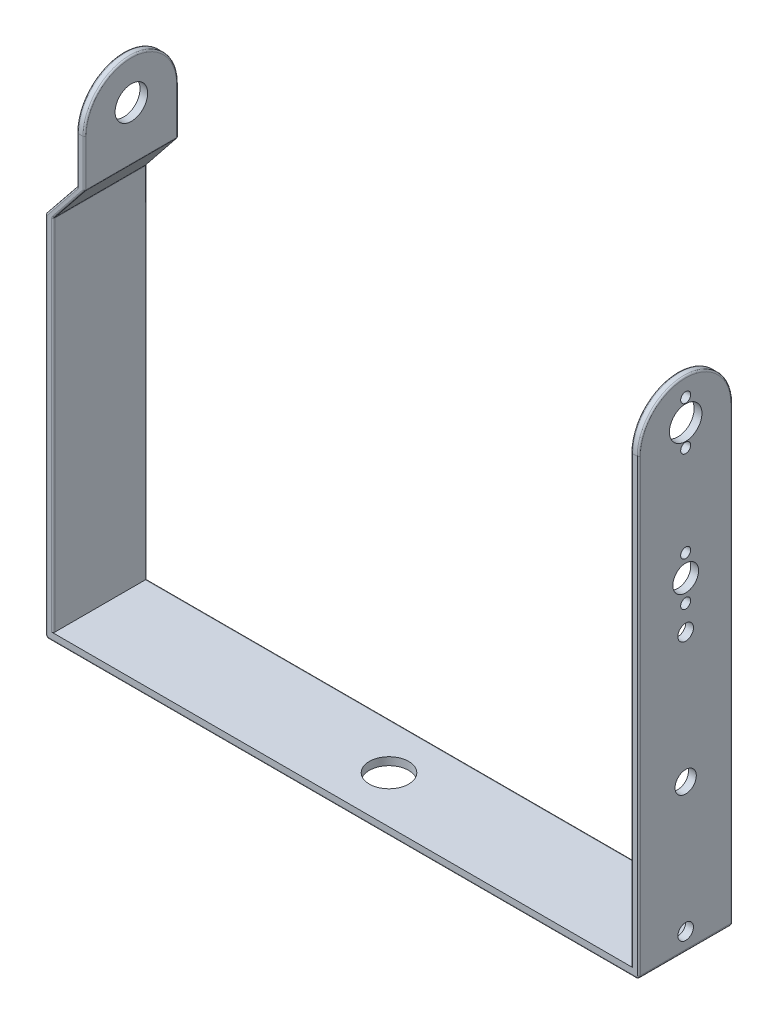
ISO-10303-21;
HEADER;
FILE_DESCRIPTION(('STEP AP214'),'2;1');
FILE_NAME('part.step','',(''),(''),'','','');
FILE_SCHEMA(('AUTOMOTIVE_DESIGN { 1 0 10303 214 1 1 1 1 }'));
ENDSEC;
DATA;
#1=APPLICATION_CONTEXT('core data for automotive mechanical design processes');
#2=APPLICATION_PROTOCOL_DEFINITION('international standard','automotive_design',2000,#1);
#3=PRODUCT_CONTEXT('',#1,'mechanical');
#4=PRODUCT('Part','Part','',(#3));
#5=PRODUCT_RELATED_PRODUCT_CATEGORY('part','',(#4));
#6=PRODUCT_DEFINITION_FORMATION('','',#4);
#7=PRODUCT_DEFINITION_CONTEXT('part definition',#1,'design');
#8=PRODUCT_DEFINITION('design','',#6,#7);
#9=PRODUCT_DEFINITION_SHAPE('','',#8);
#10=(LENGTH_UNIT() NAMED_UNIT(*) SI_UNIT(.MILLI.,.METRE.));
#11=(NAMED_UNIT(*) PLANE_ANGLE_UNIT() SI_UNIT($,.RADIAN.));
#12=(NAMED_UNIT(*) SI_UNIT($,.STERADIAN.) SOLID_ANGLE_UNIT());
#13=UNCERTAINTY_MEASURE_WITH_UNIT(LENGTH_MEASURE(1.E-05),#10,'distance_accuracy_value','');
#14=(GEOMETRIC_REPRESENTATION_CONTEXT(3) GLOBAL_UNCERTAINTY_ASSIGNED_CONTEXT((#13)) GLOBAL_UNIT_ASSIGNED_CONTEXT((#10,
#11,#12)) REPRESENTATION_CONTEXT('',''));
#15=CARTESIAN_POINT('',(0.,0.,0.));
#16=DIRECTION('',(0.,0.,1.));
#17=DIRECTION('',(1.,0.,0.));
#18=AXIS2_PLACEMENT_3D('',#15,#16,#17);
#19=CARTESIAN_POINT('',(-177.5,-113.347270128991,30.));
#20=DIRECTION('',(1.,0.,0.));
#21=DIRECTION('',(0.,1.,0.));
#22=AXIS2_PLACEMENT_3D('',#19,#20,#21);
#23=PLANE('',#22);
#24=DIRECTION('',(0.,0.,1.));
#25=VECTOR('',#24,1.);
#26=CARTESIAN_POINT('',(-177.5,130.175390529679,30.));
#27=LINE('',#26,#25);
#28=CARTESIAN_POINT('',(-177.5,130.175390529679,29.5));
#29=VERTEX_POINT('',#28);
#30=CARTESIAN_POINT('',(-177.5,130.175390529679,0.5));
#31=VERTEX_POINT('',#30);
#32=EDGE_CURVE('E372',#29,#31,#27,.F.);
#33=ORIENTED_EDGE('',*,*,#32,.T.);
#34=DIRECTION('',(0.,-1.,0.));
#35=VECTOR('',#34,1.);
#36=CARTESIAN_POINT('',(-177.5,145.,0.5));
#37=LINE('',#36,#35);
#38=CARTESIAN_POINT('',(-177.5,145.,0.499999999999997));
#39=VERTEX_POINT('',#38);
#40=EDGE_CURVE('E378',#31,#39,#37,.F.);
#41=ORIENTED_EDGE('',*,*,#40,.T.);
#42=CARTESIAN_POINT('',(-177.5,145.,15.));
#43=DIRECTION('',(1.,0.,0.));
#44=DIRECTION('',(0.,1.,0.));
#45=AXIS2_PLACEMENT_3D('',#42,#43,#44);
#46=CIRCLE('',#45,14.5);
#47=CARTESIAN_POINT('',(-177.5,145.,29.5));
#48=VERTEX_POINT('',#47);
#49=EDGE_CURVE('E376',#39,#48,#46,.T.);
#50=ORIENTED_EDGE('',*,*,#49,.T.);
#51=DIRECTION('',(0.,-1.,0.));
#52=VECTOR('',#51,1.);
#53=CARTESIAN_POINT('',(-177.5,-113.347270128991,29.5));
#54=LINE('',#53,#52);
#55=EDGE_CURVE('E374',#48,#29,#54,.T.);
#56=ORIENTED_EDGE('',*,*,#55,.T.);
#57=EDGE_LOOP('',(#33,#41,#50,#56));
#58=FACE_BOUND('',#57,.T.);
#59=CARTESIAN_POINT('',(-177.5,147.1,15.));
#60=DIRECTION('',(1.,0.,0.));
#61=DIRECTION('',(0.,1.,0.));
#62=AXIS2_PLACEMENT_3D('',#59,#60,#61);
#63=CIRCLE('',#62,5.21);
#64=CARTESIAN_POINT('',(-177.5,152.31,15.));
#65=VERTEX_POINT('',#64);
#66=EDGE_CURVE('E481',#65,#65,#63,.T.);
#67=ORIENTED_EDGE('',*,*,#66,.F.);
#68=EDGE_LOOP('',(#67));
#69=FACE_BOUND('',#68,.T.);
#70=ADVANCED_FACE('F33',(#58,#69),#23,.T.);
#71=CARTESIAN_POINT('',(-2.49999999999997,-113.347270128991,30.));
#72=DIRECTION('',(-1.,0.,0.));
#73=DIRECTION('',(0.,-1.,0.));
#74=AXIS2_PLACEMENT_3D('',#71,#72,#73);
#75=PLANE('',#74);
#76=CARTESIAN_POINT('',(-2.49999999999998,97.,15.));
#77=DIRECTION('',(-1.,0.,0.));
#78=DIRECTION('',(0.,-1.,0.));
#79=AXIS2_PLACEMENT_3D('',#76,#77,#78);
#80=CIRCLE('',#79,1.6);
#81=CARTESIAN_POINT('',(-2.49999999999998,95.4,15.));
#82=VERTEX_POINT('',#81);
#83=EDGE_CURVE('E799',#82,#82,#80,.T.);
#84=ORIENTED_EDGE('',*,*,#83,.F.);
#85=EDGE_LOOP('',(#84));
#86=FACE_BOUND('',#85,.T.);
#87=CARTESIAN_POINT('',(-2.49999999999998,111.,15.));
#88=DIRECTION('',(-1.,0.,0.));
#89=DIRECTION('',(0.,-1.,0.));
#90=AXIS2_PLACEMENT_3D('',#87,#88,#89);
#91=CIRCLE('',#90,1.6);
#92=CARTESIAN_POINT('',(-2.49999999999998,109.4,15.));
#93=VERTEX_POINT('',#92);
#94=EDGE_CURVE('E793',#93,#93,#91,.T.);
#95=ORIENTED_EDGE('',*,*,#94,.F.);
#96=EDGE_LOOP('',(#95));
#97=FACE_BOUND('',#96,.T.);
#98=CARTESIAN_POINT('',(-2.49999999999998,104.,15.));
#99=DIRECTION('',(-1.,0.,0.));
#100=DIRECTION('',(0.,-1.,0.));
#101=AXIS2_PLACEMENT_3D('',#98,#99,#100);
#102=CIRCLE('',#101,4.125);
#103=CARTESIAN_POINT('',(-2.49999999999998,99.875,15.));
#104=VERTEX_POINT('',#103);
#105=EDGE_CURVE('E787',#104,#104,#102,.T.);
#106=ORIENTED_EDGE('',*,*,#105,.F.);
#107=EDGE_LOOP('',(#106));
#108=FACE_BOUND('',#107,.T.);
#109=CARTESIAN_POINT('',(-2.49999999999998,47.5,15.));
#110=DIRECTION('',(-1.,0.,0.));
#111=DIRECTION('',(0.,-1.,0.));
#112=AXIS2_PLACEMENT_3D('',#109,#110,#111);
#113=CIRCLE('',#112,3.4);
#114=CARTESIAN_POINT('',(-2.49999999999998,44.1,15.));
#115=VERTEX_POINT('',#114);
#116=EDGE_CURVE('E781',#115,#115,#113,.T.);
#117=ORIENTED_EDGE('',*,*,#116,.F.);
#118=EDGE_LOOP('',(#117));
#119=FACE_BOUND('',#118,.T.);
#120=CARTESIAN_POINT('',(-2.49999999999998,6.00000000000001,15.));
#121=DIRECTION('',(-1.,0.,0.));
#122=DIRECTION('',(0.,-1.,0.));
#123=AXIS2_PLACEMENT_3D('',#120,#121,#122);
#124=CIRCLE('',#123,2.5);
#125=CARTESIAN_POINT('',(-2.49999999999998,3.5,15.));
#126=VERTEX_POINT('',#125);
#127=EDGE_CURVE('E778',#126,#126,#124,.T.);
#128=ORIENTED_EDGE('',*,*,#127,.F.);
#129=EDGE_LOOP('',(#128));
#130=FACE_BOUND('',#129,.T.);
#131=CARTESIAN_POINT('',(-2.49999999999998,89.,15.));
#132=DIRECTION('',(-1.,0.,0.));
#133=DIRECTION('',(0.,-1.,0.));
#134=AXIS2_PLACEMENT_3D('',#131,#132,#133);
#135=CIRCLE('',#134,2.5);
#136=CARTESIAN_POINT('',(-2.49999999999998,86.5,15.));
#137=VERTEX_POINT('',#136);
#138=EDGE_CURVE('E772',#137,#137,#135,.T.);
#139=ORIENTED_EDGE('',*,*,#138,.F.);
#140=EDGE_LOOP('',(#139));
#141=FACE_BOUND('',#140,.T.);
#142=CARTESIAN_POINT('',(-2.49999999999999,154.1,15.));
#143=DIRECTION('',(-1.,0.,0.));
#144=DIRECTION('',(0.,-1.,0.));
#145=AXIS2_PLACEMENT_3D('',#142,#143,#144);
#146=CIRCLE('',#145,1.6);
#147=CARTESIAN_POINT('',(-2.49999999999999,152.5,15.));
#148=VERTEX_POINT('',#147);
#149=EDGE_CURVE('E763',#148,#148,#146,.T.);
#150=ORIENTED_EDGE('',*,*,#149,.F.);
#151=EDGE_LOOP('',(#150));
#152=FACE_BOUND('',#151,.T.);
#153=CARTESIAN_POINT('',(-2.49999999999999,140.1,15.));
#154=DIRECTION('',(-1.,0.,0.));
#155=DIRECTION('',(0.,-1.,0.));
#156=AXIS2_PLACEMENT_3D('',#153,#154,#155);
#157=CIRCLE('',#156,1.6);
#158=CARTESIAN_POINT('',(-2.49999999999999,138.5,15.));
#159=VERTEX_POINT('',#158);
#160=EDGE_CURVE('E755',#159,#159,#157,.T.);
#161=ORIENTED_EDGE('',*,*,#160,.F.);
#162=EDGE_LOOP('',(#161));
#163=FACE_BOUND('',#162,.T.);
#164=CARTESIAN_POINT('',(-2.49999999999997,147.1,15.));
#165=DIRECTION('',(-1.,0.,0.));
#166=DIRECTION('',(0.,-1.,0.));
#167=AXIS2_PLACEMENT_3D('',#164,#165,#166);
#168=CIRCLE('',#167,5.21);
#169=CARTESIAN_POINT('',(-2.49999999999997,141.89,15.));
#170=VERTEX_POINT('',#169);
#171=EDGE_CURVE('E595',#170,#170,#168,.T.);
#172=ORIENTED_EDGE('',*,*,#171,.F.);
#173=EDGE_LOOP('',(#172));
#174=FACE_BOUND('',#173,.T.);
#175=DIRECTION('',(0.,0.,-1.));
#176=VECTOR('',#175,1.);
#177=CARTESIAN_POINT('',(-2.49999999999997,2.5,30.));
#178=LINE('',#177,#176);
#179=CARTESIAN_POINT('',(-2.49999999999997,2.5,29.5));
#180=VERTEX_POINT('',#179);
#181=CARTESIAN_POINT('',(-2.49999999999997,2.5,0.5));
#182=VERTEX_POINT('',#181);
#183=EDGE_CURVE('E432',#180,#182,#178,.T.);
#184=ORIENTED_EDGE('',*,*,#183,.F.);
#185=DIRECTION('',(0.,1.,0.));
#186=VECTOR('',#185,1.);
#187=CARTESIAN_POINT('',(-2.49999999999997,-113.347270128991,29.5));
#188=LINE('',#187,#186);
#189=CARTESIAN_POINT('',(-2.49999999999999,145.,29.5));
#190=VERTEX_POINT('',#189);
#191=EDGE_CURVE('E370',#180,#190,#188,.T.);
#192=ORIENTED_EDGE('',*,*,#191,.T.);
#193=CARTESIAN_POINT('',(-2.49999999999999,145.,15.));
#194=DIRECTION('',(-1.,0.,0.));
#195=DIRECTION('',(0.,-1.,0.));
#196=AXIS2_PLACEMENT_3D('',#193,#194,#195);
#197=CIRCLE('',#196,14.5);
#198=CARTESIAN_POINT('',(-2.49999999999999,145.,0.5));
#199=VERTEX_POINT('',#198);
#200=EDGE_CURVE('E368',#190,#199,#197,.T.);
#201=ORIENTED_EDGE('',*,*,#200,.T.);
#202=DIRECTION('',(0.,1.,0.));
#203=VECTOR('',#202,1.);
#204=CARTESIAN_POINT('',(-2.49999999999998,2.5,0.5));
#205=LINE('',#204,#203);
#206=EDGE_CURVE('E366',#199,#182,#205,.F.);
#207=ORIENTED_EDGE('',*,*,#206,.T.);
#208=EDGE_LOOP('',(#184,#192,#201,#207));
#209=FACE_BOUND('',#208,.T.);
#210=ADVANCED_FACE('F35',(#86,#97,#108,#119,#130,#141,#152,#163,#174,#209),#75,.T.);
#211=CARTESIAN_POINT('',(0.,-113.347270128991,30.));
#212=DIRECTION('',(1.,0.,0.));
#213=DIRECTION('',(0.,1.,0.));
#214=AXIS2_PLACEMENT_3D('',#211,#212,#213);
#215=PLANE('',#214);
#216=CARTESIAN_POINT('',(0.,97.,15.));
#217=DIRECTION('',(1.,0.,0.));
#218=DIRECTION('',(0.,1.,0.));
#219=AXIS2_PLACEMENT_3D('',#216,#217,#218);
#220=CIRCLE('',#219,1.6);
#221=CARTESIAN_POINT('',(0.,98.6,15.));
#222=VERTEX_POINT('',#221);
#223=EDGE_CURVE('E802',#222,#222,#220,.T.);
#224=ORIENTED_EDGE('',*,*,#223,.F.);
#225=EDGE_LOOP('',(#224));
#226=FACE_BOUND('',#225,.T.);
#227=CARTESIAN_POINT('',(0.,111.,15.));
#228=DIRECTION('',(1.,0.,0.));
#229=DIRECTION('',(0.,1.,0.));
#230=AXIS2_PLACEMENT_3D('',#227,#228,#229);
#231=CIRCLE('',#230,1.6);
#232=CARTESIAN_POINT('',(0.,112.6,15.));
#233=VERTEX_POINT('',#232);
#234=EDGE_CURVE('E796',#233,#233,#231,.T.);
#235=ORIENTED_EDGE('',*,*,#234,.F.);
#236=EDGE_LOOP('',(#235));
#237=FACE_BOUND('',#236,.T.);
#238=CARTESIAN_POINT('',(0.,104.,15.));
#239=DIRECTION('',(1.,0.,0.));
#240=DIRECTION('',(0.,1.,0.));
#241=AXIS2_PLACEMENT_3D('',#238,#239,#240);
#242=CIRCLE('',#241,4.125);
#243=CARTESIAN_POINT('',(0.,108.125,15.));
#244=VERTEX_POINT('',#243);
#245=EDGE_CURVE('E790',#244,#244,#242,.T.);
#246=ORIENTED_EDGE('',*,*,#245,.F.);
#247=EDGE_LOOP('',(#246));
#248=FACE_BOUND('',#247,.T.);
#249=CARTESIAN_POINT('',(0.,47.5,15.));
#250=DIRECTION('',(1.,0.,0.));
#251=DIRECTION('',(0.,1.,0.));
#252=AXIS2_PLACEMENT_3D('',#249,#250,#251);
#253=CIRCLE('',#252,3.4);
#254=CARTESIAN_POINT('',(0.,50.9,15.));
#255=VERTEX_POINT('',#254);
#256=EDGE_CURVE('E784',#255,#255,#253,.T.);
#257=ORIENTED_EDGE('',*,*,#256,.F.);
#258=EDGE_LOOP('',(#257));
#259=FACE_BOUND('',#258,.T.);
#260=CARTESIAN_POINT('',(0.,6.00000000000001,15.));
#261=DIRECTION('',(-1.,0.,0.));
#262=DIRECTION('',(0.,-1.,0.));
#263=AXIS2_PLACEMENT_3D('',#260,#261,#262);
#264=CIRCLE('',#263,2.5);
#265=CARTESIAN_POINT('',(0.,3.5,15.));
#266=VERTEX_POINT('',#265);
#267=EDGE_CURVE('E775',#266,#266,#264,.T.);
#268=ORIENTED_EDGE('',*,*,#267,.T.);
#269=EDGE_LOOP('',(#268));
#270=FACE_BOUND('',#269,.T.);
#271=CARTESIAN_POINT('',(0.,89.,15.));
#272=DIRECTION('',(-1.,0.,0.));
#273=DIRECTION('',(0.,-1.,0.));
#274=AXIS2_PLACEMENT_3D('',#271,#272,#273);
#275=CIRCLE('',#274,2.5);
#276=CARTESIAN_POINT('',(0.,86.5,15.));
#277=VERTEX_POINT('',#276);
#278=EDGE_CURVE('E769',#277,#277,#275,.T.);
#279=ORIENTED_EDGE('',*,*,#278,.T.);
#280=EDGE_LOOP('',(#279));
#281=FACE_BOUND('',#280,.T.);
#282=CARTESIAN_POINT('',(0.,154.1,15.));
#283=DIRECTION('',(1.,0.,0.));
#284=DIRECTION('',(0.,-1.,0.));
#285=AXIS2_PLACEMENT_3D('',#282,#283,#284);
#286=CIRCLE('',#285,1.6);
#287=CARTESIAN_POINT('',(0.,152.5,15.));
#288=VERTEX_POINT('',#287);
#289=EDGE_CURVE('E766',#288,#288,#286,.T.);
#290=ORIENTED_EDGE('',*,*,#289,.F.);
#291=EDGE_LOOP('',(#290));
#292=FACE_BOUND('',#291,.T.);
#293=CARTESIAN_POINT('',(0.,140.1,15.));
#294=DIRECTION('',(1.,0.,0.));
#295=DIRECTION('',(0.,1.,0.));
#296=AXIS2_PLACEMENT_3D('',#293,#294,#295);
#297=CIRCLE('',#296,1.6);
#298=CARTESIAN_POINT('',(0.,141.7,15.));
#299=VERTEX_POINT('',#298);
#300=EDGE_CURVE('E760',#299,#299,#297,.T.);
#301=ORIENTED_EDGE('',*,*,#300,.F.);
#302=EDGE_LOOP('',(#301));
#303=FACE_BOUND('',#302,.T.);
#304=CARTESIAN_POINT('',(0.,147.1,15.));
#305=DIRECTION('',(1.,0.,0.));
#306=DIRECTION('',(0.,1.,0.));
#307=AXIS2_PLACEMENT_3D('',#304,#305,#306);
#308=CIRCLE('',#307,5.21);
#309=CARTESIAN_POINT('',(0.,152.31,15.));
#310=VERTEX_POINT('',#309);
#311=EDGE_CURVE('E591',#310,#310,#308,.T.);
#312=ORIENTED_EDGE('',*,*,#311,.F.);
#313=EDGE_LOOP('',(#312));
#314=FACE_BOUND('',#313,.T.);
#315=DIRECTION('',(0.,0.,-1.));
#316=VECTOR('',#315,1.);
#317=CARTESIAN_POINT('',(0.,1.,0.));
#318=LINE('',#317,#316);
#319=CARTESIAN_POINT('',(0.,1.,29.5));
#320=VERTEX_POINT('',#319);
#321=CARTESIAN_POINT('',(0.,1.,0.5));
#322=VERTEX_POINT('',#321);
#323=EDGE_CURVE('E609',#320,#322,#318,.T.);
#324=ORIENTED_EDGE('',*,*,#323,.T.);
#325=DIRECTION('',(0.,-1.,0.));
#326=VECTOR('',#325,1.);
#327=CARTESIAN_POINT('',(0.,145.,0.5));
#328=LINE('',#327,#326);
#329=CARTESIAN_POINT('',(0.,145.,0.499999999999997));
#330=VERTEX_POINT('',#329);
#331=EDGE_CURVE('E404',#322,#330,#328,.F.);
#332=ORIENTED_EDGE('',*,*,#331,.T.);
#333=CARTESIAN_POINT('',(0.,145.,15.));
#334=DIRECTION('',(1.,0.,0.));
#335=DIRECTION('',(0.,1.,0.));
#336=AXIS2_PLACEMENT_3D('',#333,#334,#335);
#337=CIRCLE('',#336,14.5);
#338=CARTESIAN_POINT('',(0.,145.,29.5));
#339=VERTEX_POINT('',#338);
#340=EDGE_CURVE('E402',#330,#339,#337,.T.);
#341=ORIENTED_EDGE('',*,*,#340,.T.);
#342=DIRECTION('',(0.,-1.,0.));
#343=VECTOR('',#342,1.);
#344=CARTESIAN_POINT('',(0.,-113.347270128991,29.5));
#345=LINE('',#344,#343);
#346=EDGE_CURVE('E400',#339,#320,#345,.T.);
#347=ORIENTED_EDGE('',*,*,#346,.T.);
#348=EDGE_LOOP('',(#324,#332,#341,#347));
#349=FACE_BOUND('',#348,.T.);
#350=ADVANCED_FACE('F717',(#226,#237,#248,#259,#270,#281,#292,#303,#314,#349),#215,.T.);
#351=CARTESIAN_POINT('',(-179.93840728,-113.347270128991,0.));
#352=DIRECTION('',(1.,0.,0.));
#353=DIRECTION('',(0.,0.,-1.));
#354=AXIS2_PLACEMENT_3D('',#351,#352,#353);
#355=PLANE('',#354);
#356=DIRECTION('',(0.,1.,0.));
#357=VECTOR('',#356,1.);
#358=CARTESIAN_POINT('',(-179.93840728,145.,29.5));
#359=LINE('',#358,#357);
#360=CARTESIAN_POINT('',(-179.93840728,130.17623250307,29.5));
#361=VERTEX_POINT('',#360);
#362=CARTESIAN_POINT('',(-179.93840728,145.,29.5));
#363=VERTEX_POINT('',#362);
#364=EDGE_CURVE('E298',#361,#363,#359,.T.);
#365=ORIENTED_EDGE('',*,*,#364,.T.);
#366=CARTESIAN_POINT('',(-179.93840728,145.,15.));
#367=DIRECTION('',(1.,0.,0.));
#368=DIRECTION('',(0.,0.,-1.));
#369=AXIS2_PLACEMENT_3D('',#366,#367,#368);
#370=CIRCLE('',#369,14.5);
#371=CARTESIAN_POINT('',(-179.93840728,145.,0.5));
#372=VERTEX_POINT('',#371);
#373=EDGE_CURVE('E304',#363,#372,#370,.F.);
#374=ORIENTED_EDGE('',*,*,#373,.T.);
#375=DIRECTION('',(0.,1.,0.));
#376=VECTOR('',#375,1.);
#377=CARTESIAN_POINT('',(-179.93840728,-113.347270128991,0.5));
#378=LINE('',#377,#376);
#379=CARTESIAN_POINT('',(-179.93840728,130.17623250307,0.5));
#380=VERTEX_POINT('',#379);
#381=EDGE_CURVE('E286',#372,#380,#378,.F.);
#382=ORIENTED_EDGE('',*,*,#381,.T.);
#383=DIRECTION('',(0.,0.,1.));
#384=VECTOR('',#383,1.);
#385=CARTESIAN_POINT('',(-179.93840728,130.17623250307,30.));
#386=LINE('',#385,#384);
#387=EDGE_CURVE('E296',#380,#361,#386,.T.);
#388=ORIENTED_EDGE('',*,*,#387,.T.);
#389=EDGE_LOOP('',(#365,#374,#382,#388));
#390=FACE_BOUND('',#389,.T.);
#391=CARTESIAN_POINT('',(-179.93840728,147.1,15.));
#392=DIRECTION('',(1.,0.,0.));
#393=DIRECTION('',(0.,0.,-1.));
#394=AXIS2_PLACEMENT_3D('',#391,#392,#393);
#395=CIRCLE('',#394,5.21);
#396=CARTESIAN_POINT('',(-179.93840728,147.1,9.79));
#397=VERTEX_POINT('',#396);
#398=EDGE_CURVE('E594',#397,#397,#395,.T.);
#399=ORIENTED_EDGE('',*,*,#398,.T.);
#400=EDGE_LOOP('',(#399));
#401=FACE_BOUND('',#400,.T.);
#402=ADVANCED_FACE('F663',(#390,#401),#355,.F.);
#403=CARTESIAN_POINT('',(-95.,-113.347270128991,30.));
#404=DIRECTION('',(0.,0.,1.));
#405=DIRECTION('',(1.,0.,0.));
#406=AXIS2_PLACEMENT_3D('',#403,#404,#405);
#407=PLANE('',#406);
#408=DIRECTION('',(1.,0.,0.));
#409=VECTOR('',#408,1.);
#410=CARTESIAN_POINT('',(-190.,145.,30.));
#411=LINE('',#410,#409);
#412=CARTESIAN_POINT('',(-1.99999999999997,145.,30.));
#413=VERTEX_POINT('',#412);
#414=CARTESIAN_POINT('',(-0.5,145.,30.));
#415=VERTEX_POINT('',#414);
#416=EDGE_CURVE('E587',#413,#415,#411,.T.);
#417=ORIENTED_EDGE('',*,*,#416,.F.);
#418=DIRECTION('',(0.,1.,0.));
#419=VECTOR('',#418,1.);
#420=CARTESIAN_POINT('',(-1.99999999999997,-113.347270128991,30.));
#421=LINE('',#420,#419);
#422=CARTESIAN_POINT('',(-1.99999999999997,2.5,30.));
#423=VERTEX_POINT('',#422);
#424=EDGE_CURVE('E363',#413,#423,#421,.F.);
#425=ORIENTED_EDGE('',*,*,#424,.T.);
#426=DIRECTION('',(1.,0.,0.));
#427=VECTOR('',#426,1.);
#428=CARTESIAN_POINT('',(-95.,2.5,30.));
#429=LINE('',#428,#427);
#430=CARTESIAN_POINT('',(-188.,2.5,30.));
#431=VERTEX_POINT('',#430);
#432=EDGE_CURVE('E434',#431,#423,#429,.T.);
#433=ORIENTED_EDGE('',*,*,#432,.F.);
#434=DIRECTION('',(0.,-1.,0.));
#435=VECTOR('',#434,1.);
#436=CARTESIAN_POINT('',(-188.,117.5,30.));
#437=LINE('',#436,#435);
#438=CARTESIAN_POINT('',(-188.,117.324609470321,30.));
#439=VERTEX_POINT('',#438);
#440=EDGE_CURVE('E340',#431,#439,#437,.F.);
#441=ORIENTED_EDGE('',*,*,#440,.T.);
#442=CARTESIAN_POINT('',(-187.,117.324609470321,30.));
#443=DIRECTION('',(0.,0.,1.));
#444=DIRECTION('',(1.,0.,0.));
#445=AXIS2_PLACEMENT_3D('',#442,#443,#444);
#446=CIRCLE('',#445,1.);
#447=CARTESIAN_POINT('',(-187.780868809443,117.949304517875,30.));
#448=VERTEX_POINT('',#447);
#449=EDGE_CURVE('E337',#448,#439,#446,.T.);
#450=ORIENTED_EDGE('',*,*,#449,.F.);
#451=DIRECTION('',(0.624695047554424,0.780868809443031,0.));
#452=VECTOR('',#451,1.);
#453=CARTESIAN_POINT('',(-264.401297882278,22.1737681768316,30.));
#454=LINE('',#453,#452);
#455=CARTESIAN_POINT('',(-178.,130.175390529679,30.));
#456=VERTEX_POINT('',#455);
#457=EDGE_CURVE('E342',#448,#456,#454,.T.);
#458=ORIENTED_EDGE('',*,*,#457,.T.);
#459=DIRECTION('',(0.,-1.,0.));
#460=VECTOR('',#459,1.);
#461=CARTESIAN_POINT('',(-178.,-113.347270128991,30.));
#462=LINE('',#461,#460);
#463=CARTESIAN_POINT('',(-178.,145.,30.));
#464=VERTEX_POINT('',#463);
#465=EDGE_CURVE('E344',#456,#464,#462,.F.);
#466=ORIENTED_EDGE('',*,*,#465,.T.);
#467=CARTESIAN_POINT('',(-179.43840728,145.,30.));
#468=VERTEX_POINT('',#467);
#469=EDGE_CURVE('E590',#468,#464,#411,.T.);
#470=ORIENTED_EDGE('',*,*,#469,.F.);
#471=DIRECTION('',(0.,1.,0.));
#472=VECTOR('',#471,1.);
#473=CARTESIAN_POINT('',(-179.43840728,130.,30.));
#474=LINE('',#473,#472);
#475=CARTESIAN_POINT('',(-179.43840728,130.17623250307,30.));
#476=VERTEX_POINT('',#475);
#477=EDGE_CURVE('E361',#468,#476,#474,.F.);
#478=ORIENTED_EDGE('',*,*,#477,.T.);
#479=CARTESIAN_POINT('',(-180.43840728,130.17623250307,30.));
#480=DIRECTION('',(0.,0.,1.));
#481=DIRECTION('',(1.,0.,0.));
#482=AXIS2_PLACEMENT_3D('',#479,#480,#481);
#483=CIRCLE('',#482,1.);
#484=CARTESIAN_POINT('',(-179.659414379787,129.549199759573,30.));
#485=VERTEX_POINT('',#484);
#486=EDGE_CURVE('E358',#485,#476,#483,.T.);
#487=ORIENTED_EDGE('',*,*,#486,.F.);
#488=DIRECTION('',(0.627032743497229,0.77899290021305,0.));
#489=VECTOR('',#488,1.);
#490=CARTESIAN_POINT('',(-189.610503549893,117.186483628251,30.));
#491=LINE('',#490,#489);
#492=CARTESIAN_POINT('',(-189.5,117.32376749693,30.));
#493=VERTEX_POINT('',#492);
#494=EDGE_CURVE('E348',#485,#493,#491,.F.);
#495=ORIENTED_EDGE('',*,*,#494,.T.);
#496=DIRECTION('',(0.,-1.,0.));
#497=VECTOR('',#496,1.);
#498=CARTESIAN_POINT('',(-189.5,1.,30.));
#499=LINE('',#498,#497);
#500=CARTESIAN_POINT('',(-189.5,1.,30.));
#501=VERTEX_POINT('',#500);
#502=EDGE_CURVE('E346',#493,#501,#499,.T.);
#503=ORIENTED_EDGE('',*,*,#502,.T.);
#504=CARTESIAN_POINT('',(-189.,1.,30.));
#505=DIRECTION('',(0.,0.,1.));
#506=DIRECTION('',(1.,0.,0.));
#507=AXIS2_PLACEMENT_3D('',#504,#505,#506);
#508=CIRCLE('',#507,0.5);
#509=CARTESIAN_POINT('',(-189.,0.5,30.));
#510=VERTEX_POINT('',#509);
#511=EDGE_CURVE('E350',#501,#510,#508,.T.);
#512=ORIENTED_EDGE('',*,*,#511,.T.);
#513=DIRECTION('',(1.,0.,0.));
#514=VECTOR('',#513,1.);
#515=CARTESIAN_POINT('',(-1.,0.5,30.));
#516=LINE('',#515,#514);
#517=CARTESIAN_POINT('',(-1.,0.5,30.));
#518=VERTEX_POINT('',#517);
#519=EDGE_CURVE('E352',#510,#518,#516,.T.);
#520=ORIENTED_EDGE('',*,*,#519,.T.);
#521=CARTESIAN_POINT('',(-1.,1.,30.));
#522=DIRECTION('',(0.,0.,1.));
#523=DIRECTION('',(1.,0.,0.));
#524=AXIS2_PLACEMENT_3D('',#521,#522,#523);
#525=CIRCLE('',#524,0.5);
#526=CARTESIAN_POINT('',(-0.5,1.,30.));
#527=VERTEX_POINT('',#526);
#528=EDGE_CURVE('E354',#518,#527,#525,.T.);
#529=ORIENTED_EDGE('',*,*,#528,.T.);
#530=DIRECTION('',(0.,-1.,0.));
#531=VECTOR('',#530,1.);
#532=CARTESIAN_POINT('',(-0.5,-113.347270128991,30.));
#533=LINE('',#532,#531);
#534=EDGE_CURVE('E356',#527,#415,#533,.F.);
#535=ORIENTED_EDGE('',*,*,#534,.T.);
#536=EDGE_LOOP('',(#417,#425,#433,#441,#450,#458,#466,#470,#478,#487,#495,#503,#512,#520,#529,#535));
#537=FACE_BOUND('',#536,.T.);
#538=ADVANCED_FACE('F670',(#537),#407,.T.);
#539=CARTESIAN_POINT('',(-95.,-113.347270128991,0.));
#540=DIRECTION('',(0.,0.,1.));
#541=DIRECTION('',(1.,0.,0.));
#542=AXIS2_PLACEMENT_3D('',#539,#540,#541);
#543=PLANE('',#542);
#544=DIRECTION('',(1.,0.,0.));
#545=VECTOR('',#544,1.);
#546=CARTESIAN_POINT('',(-190.,145.,0.));
#547=LINE('',#546,#545);
#548=CARTESIAN_POINT('',(-1.99999999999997,145.,0.));
#549=VERTEX_POINT('',#548);
#550=CARTESIAN_POINT('',(-0.5,145.,0.));
#551=VERTEX_POINT('',#550);
#552=EDGE_CURVE('E281',#549,#551,#547,.T.);
#553=ORIENTED_EDGE('',*,*,#552,.T.);
#554=DIRECTION('',(0.,-1.,0.));
#555=VECTOR('',#554,1.);
#556=CARTESIAN_POINT('',(-0.5,1.,0.));
#557=LINE('',#556,#555);
#558=CARTESIAN_POINT('',(-0.5,1.,0.));
#559=VERTEX_POINT('',#558);
#560=EDGE_CURVE('E329',#551,#559,#557,.T.);
#561=ORIENTED_EDGE('',*,*,#560,.T.);
#562=CARTESIAN_POINT('',(-1.,1.,0.));
#563=DIRECTION('',(0.,0.,1.));
#564=DIRECTION('',(1.,0.,0.));
#565=AXIS2_PLACEMENT_3D('',#562,#563,#564);
#566=CIRCLE('',#565,0.5);
#567=CARTESIAN_POINT('',(-1.,0.5,0.));
#568=VERTEX_POINT('',#567);
#569=EDGE_CURVE('E327',#559,#568,#566,.F.);
#570=ORIENTED_EDGE('',*,*,#569,.T.);
#571=DIRECTION('',(1.,0.,0.));
#572=VECTOR('',#571,1.);
#573=CARTESIAN_POINT('',(-95.,0.5,0.));
#574=LINE('',#573,#572);
#575=CARTESIAN_POINT('',(-189.,0.5,0.));
#576=VERTEX_POINT('',#575);
#577=EDGE_CURVE('E325',#568,#576,#574,.F.);
#578=ORIENTED_EDGE('',*,*,#577,.T.);
#579=CARTESIAN_POINT('',(-189.,1.,0.));
#580=DIRECTION('',(0.,0.,1.));
#581=DIRECTION('',(1.,0.,0.));
#582=AXIS2_PLACEMENT_3D('',#579,#580,#581);
#583=CIRCLE('',#582,0.5);
#584=CARTESIAN_POINT('',(-189.5,1.,0.));
#585=VERTEX_POINT('',#584);
#586=EDGE_CURVE('E269',#576,#585,#583,.F.);
#587=ORIENTED_EDGE('',*,*,#586,.T.);
#588=DIRECTION('',(0.,-1.,0.));
#589=VECTOR('',#588,1.);
#590=CARTESIAN_POINT('',(-189.5,-113.347270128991,0.));
#591=LINE('',#590,#589);
#592=CARTESIAN_POINT('',(-189.5,117.32376749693,0.));
#593=VERTEX_POINT('',#592);
#594=EDGE_CURVE('E270',#585,#593,#591,.F.);
#595=ORIENTED_EDGE('',*,*,#594,.T.);
#596=DIRECTION('',(0.627032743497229,0.77899290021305,0.));
#597=VECTOR('',#596,1.);
#598=CARTESIAN_POINT('',(-265.017632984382,23.5045841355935,0.));
#599=LINE('',#598,#597);
#600=CARTESIAN_POINT('',(-179.659414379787,129.549199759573,0.));
#601=VERTEX_POINT('',#600);
#602=EDGE_CURVE('E321',#593,#601,#599,.T.);
#603=ORIENTED_EDGE('',*,*,#602,.T.);
#604=CARTESIAN_POINT('',(-180.43840728,130.17623250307,0.));
#605=DIRECTION('',(0.,0.,1.));
#606=DIRECTION('',(1.,0.,0.));
#607=AXIS2_PLACEMENT_3D('',#604,#605,#606);
#608=CIRCLE('',#607,1.);
#609=CARTESIAN_POINT('',(-179.43840728,130.17623250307,0.));
#610=VERTEX_POINT('',#609);
#611=EDGE_CURVE('E264',#610,#601,#608,.F.);
#612=ORIENTED_EDGE('',*,*,#611,.F.);
#613=DIRECTION('',(0.,1.,0.));
#614=VECTOR('',#613,1.);
#615=CARTESIAN_POINT('',(-179.43840728,-113.347270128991,0.));
#616=LINE('',#615,#614);
#617=CARTESIAN_POINT('',(-179.43840728,145.,0.));
#618=VERTEX_POINT('',#617);
#619=EDGE_CURVE('E257',#610,#618,#616,.T.);
#620=ORIENTED_EDGE('',*,*,#619,.T.);
#621=CARTESIAN_POINT('',(-178.,145.,0.));
#622=VERTEX_POINT('',#621);
#623=EDGE_CURVE('E261',#618,#622,#547,.T.);
#624=ORIENTED_EDGE('',*,*,#623,.T.);
#625=DIRECTION('',(0.,-1.,0.));
#626=VECTOR('',#625,1.);
#627=CARTESIAN_POINT('',(-178.,130.,0.));
#628=LINE('',#627,#626);
#629=CARTESIAN_POINT('',(-178.,130.175390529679,0.));
#630=VERTEX_POINT('',#629);
#631=EDGE_CURVE('E311',#622,#630,#628,.T.);
#632=ORIENTED_EDGE('',*,*,#631,.T.);
#633=DIRECTION('',(0.624695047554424,0.780868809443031,0.));
#634=VECTOR('',#633,1.);
#635=CARTESIAN_POINT('',(-187.890434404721,117.812347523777,0.));
#636=LINE('',#635,#634);
#637=CARTESIAN_POINT('',(-187.780868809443,117.949304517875,0.));
#638=VERTEX_POINT('',#637);
#639=EDGE_CURVE('E309',#630,#638,#636,.F.);
#640=ORIENTED_EDGE('',*,*,#639,.T.);
#641=CARTESIAN_POINT('',(-187.,117.324609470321,0.));
#642=DIRECTION('',(0.,0.,1.));
#643=DIRECTION('',(1.,0.,0.));
#644=AXIS2_PLACEMENT_3D('',#641,#642,#643);
#645=CIRCLE('',#644,1.);
#646=CARTESIAN_POINT('',(-188.,117.324609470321,0.));
#647=VERTEX_POINT('',#646);
#648=EDGE_CURVE('E306',#647,#638,#645,.F.);
#649=ORIENTED_EDGE('',*,*,#648,.F.);
#650=DIRECTION('',(0.,-1.,0.));
#651=VECTOR('',#650,1.);
#652=CARTESIAN_POINT('',(-188.,-113.347270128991,0.));
#653=LINE('',#652,#651);
#654=CARTESIAN_POINT('',(-188.,2.,0.));
#655=VERTEX_POINT('',#654);
#656=EDGE_CURVE('E313',#647,#655,#653,.T.);
#657=ORIENTED_EDGE('',*,*,#656,.T.);
#658=DIRECTION('',(1.,0.,0.));
#659=VECTOR('',#658,1.);
#660=CARTESIAN_POINT('',(-2.49999999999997,2.,0.));
#661=LINE('',#660,#659);
#662=CARTESIAN_POINT('',(-1.99999999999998,2.,0.));
#663=VERTEX_POINT('',#662);
#664=EDGE_CURVE('E316',#655,#663,#661,.T.);
#665=ORIENTED_EDGE('',*,*,#664,.T.);
#666=DIRECTION('',(0.,1.,0.));
#667=VECTOR('',#666,1.);
#668=CARTESIAN_POINT('',(-1.99999999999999,145.,0.));
#669=LINE('',#668,#667);
#670=EDGE_CURVE('E318',#663,#549,#669,.T.);
#671=ORIENTED_EDGE('',*,*,#670,.T.);
#672=EDGE_LOOP('',(#553,#561,#570,#578,#587,#595,#603,#612,#620,#624,#632,#640,#649,#657,#665,#671));
#673=FACE_BOUND('',#672,.T.);
#674=ADVANCED_FACE('F260',(#673),#543,.F.);
#675=CARTESIAN_POINT('',(-95.,2.5,30.));
#676=DIRECTION('',(0.,1.,0.));
#677=DIRECTION('',(-1.,0.,0.));
#678=AXIS2_PLACEMENT_3D('',#675,#676,#677);
#679=PLANE('',#678);
#680=CARTESIAN_POINT('',(-95.,2.5,15.));
#681=DIRECTION('',(0.,1.,0.));
#682=DIRECTION('',(-1.,0.,0.));
#683=AXIS2_PLACEMENT_3D('',#680,#681,#682);
#684=CIRCLE('',#683,6.3);
#685=CARTESIAN_POINT('',(-101.3,2.5,15.));
#686=VERTEX_POINT('',#685);
#687=EDGE_CURVE('E491',#686,#686,#684,.T.);
#688=ORIENTED_EDGE('',*,*,#687,.F.);
#689=EDGE_LOOP('',(#688));
#690=FACE_BOUND('',#689,.T.);
#691=ORIENTED_EDGE('',*,*,#183,.T.);
#692=DIRECTION('',(1.,0.,0.));
#693=VECTOR('',#692,1.);
#694=CARTESIAN_POINT('',(-187.5,2.5,0.5));
#695=LINE('',#694,#693);
#696=CARTESIAN_POINT('',(-187.5,2.5,0.5));
#697=VERTEX_POINT('',#696);
#698=EDGE_CURVE('E410',#182,#697,#695,.F.);
#699=ORIENTED_EDGE('',*,*,#698,.T.);
#700=DIRECTION('',(0.,0.,1.));
#701=VECTOR('',#700,1.);
#702=CARTESIAN_POINT('',(-187.5,2.5,0.));
#703=LINE('',#702,#701);
#704=CARTESIAN_POINT('',(-187.5,2.5,29.5));
#705=VERTEX_POINT('',#704);
#706=EDGE_CURVE('E474',#697,#705,#703,.T.);
#707=ORIENTED_EDGE('',*,*,#706,.T.);
#708=CARTESIAN_POINT('',(-188.,2.5,29.5));
#709=DIRECTION('',(0.,1.,0.));
#710=DIRECTION('',(-1.,0.,0.));
#711=AXIS2_PLACEMENT_3D('',#708,#709,#710);
#712=CIRCLE('',#711,0.5);
#713=EDGE_CURVE('E11',#705,#431,#712,.F.);
#714=ORIENTED_EDGE('',*,*,#713,.T.);
#715=ORIENTED_EDGE('',*,*,#432,.T.);
#716=CARTESIAN_POINT('',(-1.99999999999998,2.5,29.5));
#717=DIRECTION('',(0.,1.,0.));
#718=DIRECTION('',(-1.,0.,0.));
#719=AXIS2_PLACEMENT_3D('',#716,#717,#718);
#720=CIRCLE('',#719,0.5);
#721=EDGE_CURVE('E41',#423,#180,#720,.F.);
#722=ORIENTED_EDGE('',*,*,#721,.T.);
#723=EDGE_LOOP('',(#691,#699,#707,#714,#715,#722));
#724=FACE_BOUND('',#723,.T.);
#725=ADVANCED_FACE('F431',(#690,#724),#679,.T.);
#726=CARTESIAN_POINT('',(-190.,-113.347270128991,30.));
#727=DIRECTION('',(1.,0.,0.));
#728=DIRECTION('',(0.,0.,-1.));
#729=AXIS2_PLACEMENT_3D('',#726,#727,#728);
#730=PLANE('',#729);
#731=DIRECTION('',(0.,0.,1.));
#732=VECTOR('',#731,1.);
#733=CARTESIAN_POINT('',(-190.,117.32376749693,30.));
#734=LINE('',#733,#732);
#735=CARTESIAN_POINT('',(-190.,117.32376749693,29.5));
#736=VERTEX_POINT('',#735);
#737=CARTESIAN_POINT('',(-190.,117.32376749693,0.5));
#738=VERTEX_POINT('',#737);
#739=EDGE_CURVE('E381',#736,#738,#734,.F.);
#740=ORIENTED_EDGE('',*,*,#739,.T.);
#741=DIRECTION('',(0.,-1.,0.));
#742=VECTOR('',#741,1.);
#743=CARTESIAN_POINT('',(-190.,-113.347270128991,0.5));
#744=LINE('',#743,#742);
#745=CARTESIAN_POINT('',(-190.,1.,0.5));
#746=VERTEX_POINT('',#745);
#747=EDGE_CURVE('E385',#738,#746,#744,.T.);
#748=ORIENTED_EDGE('',*,*,#747,.T.);
#749=DIRECTION('',(0.,0.,-1.));
#750=VECTOR('',#749,1.);
#751=CARTESIAN_POINT('',(-190.,1.,30.));
#752=LINE('',#751,#750);
#753=CARTESIAN_POINT('',(-190.,1.,29.5));
#754=VERTEX_POINT('',#753);
#755=EDGE_CURVE('E606',#746,#754,#752,.F.);
#756=ORIENTED_EDGE('',*,*,#755,.T.);
#757=DIRECTION('',(0.,-1.,0.));
#758=VECTOR('',#757,1.);
#759=CARTESIAN_POINT('',(-190.,117.5,29.5));
#760=LINE('',#759,#758);
#761=EDGE_CURVE('E383',#754,#736,#760,.F.);
#762=ORIENTED_EDGE('',*,*,#761,.T.);
#763=EDGE_LOOP('',(#740,#748,#756,#762));
#764=FACE_BOUND('',#763,.T.);
#765=ADVANCED_FACE('F694',(#764),#730,.F.);
#766=CARTESIAN_POINT('',(-95.,0.,30.));
#767=DIRECTION('',(0.,1.,0.));
#768=DIRECTION('',(0.,0.,1.));
#769=AXIS2_PLACEMENT_3D('',#766,#767,#768);
#770=PLANE('',#769);
#771=CARTESIAN_POINT('',(-95.,0.,15.));
#772=DIRECTION('',(0.,-1.,0.));
#773=DIRECTION('',(0.,0.,-1.));
#774=AXIS2_PLACEMENT_3D('',#771,#772,#773);
#775=CIRCLE('',#774,6.3);
#776=CARTESIAN_POINT('',(-95.,0.,8.7));
#777=VERTEX_POINT('',#776);
#778=EDGE_CURVE('E753',#777,#777,#775,.T.);
#779=ORIENTED_EDGE('',*,*,#778,.F.);
#780=EDGE_LOOP('',(#779));
#781=FACE_BOUND('',#780,.T.);
#782=DIRECTION('',(0.,0.,-1.));
#783=VECTOR('',#782,1.);
#784=CARTESIAN_POINT('',(-189.,0.,30.));
#785=LINE('',#784,#783);
#786=CARTESIAN_POINT('',(-189.,0.,29.5));
#787=VERTEX_POINT('',#786);
#788=CARTESIAN_POINT('',(-189.,0.,0.5));
#789=VERTEX_POINT('',#788);
#790=EDGE_CURVE('E603',#787,#789,#785,.T.);
#791=ORIENTED_EDGE('',*,*,#790,.T.);
#792=DIRECTION('',(1.,0.,0.));
#793=VECTOR('',#792,1.);
#794=CARTESIAN_POINT('',(-95.,0.,0.5));
#795=LINE('',#794,#793);
#796=CARTESIAN_POINT('',(-1.,0.,0.5));
#797=VERTEX_POINT('',#796);
#798=EDGE_CURVE('E394',#789,#797,#795,.T.);
#799=ORIENTED_EDGE('',*,*,#798,.T.);
#800=DIRECTION('',(0.,0.,-1.));
#801=VECTOR('',#800,1.);
#802=CARTESIAN_POINT('',(-1.,0.,30.));
#803=LINE('',#802,#801);
#804=CARTESIAN_POINT('',(-1.,0.,29.5));
#805=VERTEX_POINT('',#804);
#806=EDGE_CURVE('E441',#797,#805,#803,.F.);
#807=ORIENTED_EDGE('',*,*,#806,.T.);
#808=DIRECTION('',(1.,0.,0.));
#809=VECTOR('',#808,1.);
#810=CARTESIAN_POINT('',(-189.,0.,29.5));
#811=LINE('',#810,#809);
#812=EDGE_CURVE('E392',#805,#787,#811,.F.);
#813=ORIENTED_EDGE('',*,*,#812,.T.);
#814=EDGE_LOOP('',(#791,#799,#807,#813));
#815=FACE_BOUND('',#814,.T.);
#816=ADVANCED_FACE('F722',(#781,#815),#770,.F.);
#817=CARTESIAN_POINT('',(-189.,1.,30.));
#818=DIRECTION('',(0.,0.,-1.));
#819=DIRECTION('',(-1.,0.,0.));
#820=AXIS2_PLACEMENT_3D('',#817,#818,#819);
#821=CYLINDRICAL_SURFACE('',#820,1.);
#822=ORIENTED_EDGE('',*,*,#755,.F.);
#823=CARTESIAN_POINT('',(-189.,1.,0.5));
#824=DIRECTION('',(0.,0.,1.));
#825=DIRECTION('',(1.,0.,0.));
#826=AXIS2_PLACEMENT_3D('',#823,#824,#825);
#827=CIRCLE('',#826,1.);
#828=EDGE_CURVE('E390',#746,#789,#827,.T.);
#829=ORIENTED_EDGE('',*,*,#828,.T.);
#830=ORIENTED_EDGE('',*,*,#790,.F.);
#831=CARTESIAN_POINT('',(-189.,1.,29.5));
#832=DIRECTION('',(0.,0.,1.));
#833=DIRECTION('',(1.,0.,0.));
#834=AXIS2_PLACEMENT_3D('',#831,#832,#833);
#835=CIRCLE('',#834,1.);
#836=EDGE_CURVE('E388',#787,#754,#835,.F.);
#837=ORIENTED_EDGE('',*,*,#836,.T.);
#838=EDGE_LOOP('',(#822,#829,#830,#837));
#839=FACE_BOUND('',#838,.T.);
#840=ADVANCED_FACE('F724',(#839),#821,.T.);
#841=CARTESIAN_POINT('',(-1.,1.,30.));
#842=DIRECTION('',(0.,0.,1.));
#843=DIRECTION('',(1.,0.,0.));
#844=AXIS2_PLACEMENT_3D('',#841,#842,#843);
#845=CYLINDRICAL_SURFACE('',#844,1.);
#846=ORIENTED_EDGE('',*,*,#806,.F.);
#847=CARTESIAN_POINT('',(-1.,1.,0.5));
#848=DIRECTION('',(0.,0.,1.));
#849=DIRECTION('',(1.,0.,0.));
#850=AXIS2_PLACEMENT_3D('',#847,#848,#849);
#851=CIRCLE('',#850,1.);
#852=EDGE_CURVE('E398',#797,#322,#851,.T.);
#853=ORIENTED_EDGE('',*,*,#852,.T.);
#854=ORIENTED_EDGE('',*,*,#323,.F.);
#855=CARTESIAN_POINT('',(-1.,1.,29.5));
#856=DIRECTION('',(0.,0.,1.));
#857=DIRECTION('',(1.,0.,0.));
#858=AXIS2_PLACEMENT_3D('',#855,#856,#857);
#859=CIRCLE('',#858,1.);
#860=EDGE_CURVE('E396',#320,#805,#859,.F.);
#861=ORIENTED_EDGE('',*,*,#860,.T.);
#862=EDGE_LOOP('',(#846,#853,#854,#861));
#863=FACE_BOUND('',#862,.T.);
#864=ADVANCED_FACE('F720',(#863),#845,.T.);
#865=CARTESIAN_POINT('',(-187.5,2.5,0.));
#866=DIRECTION('',(-1.,0.,0.));
#867=DIRECTION('',(0.,0.,1.));
#868=AXIS2_PLACEMENT_3D('',#865,#866,#867);
#869=PLANE('',#868);
#870=ORIENTED_EDGE('',*,*,#706,.F.);
#871=DIRECTION('',(0.,-1.,0.));
#872=VECTOR('',#871,1.);
#873=CARTESIAN_POINT('',(-187.5,2.5,0.5));
#874=LINE('',#873,#872);
#875=CARTESIAN_POINT('',(-187.5,117.324609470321,0.5));
#876=VERTEX_POINT('',#875);
#877=EDGE_CURVE('E335',#697,#876,#874,.F.);
#878=ORIENTED_EDGE('',*,*,#877,.T.);
#879=DIRECTION('',(0.,0.,1.));
#880=VECTOR('',#879,1.);
#881=CARTESIAN_POINT('',(-187.5,117.324609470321,0.));
#882=LINE('',#881,#880);
#883=CARTESIAN_POINT('',(-187.5,117.324609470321,29.5));
#884=VERTEX_POINT('',#883);
#885=EDGE_CURVE('E331',#876,#884,#882,.T.);
#886=ORIENTED_EDGE('',*,*,#885,.T.);
#887=DIRECTION('',(0.,-1.,0.));
#888=VECTOR('',#887,1.);
#889=CARTESIAN_POINT('',(-187.5,2.5,29.5));
#890=LINE('',#889,#888);
#891=EDGE_CURVE('E333',#884,#705,#890,.T.);
#892=ORIENTED_EDGE('',*,*,#891,.T.);
#893=EDGE_LOOP('',(#870,#878,#886,#892));
#894=FACE_BOUND('',#893,.T.);
#895=ADVANCED_FACE('F478',(#894),#869,.F.);
#896=CARTESIAN_POINT('',(-265.407129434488,23.8181005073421,0.));
#897=DIRECTION('',(0.77899290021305,-0.627032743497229,0.));
#898=DIRECTION('',(0.627032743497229,0.77899290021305,0.));
#899=AXIS2_PLACEMENT_3D('',#896,#897,#898);
#900=PLANE('',#899);
#901=DIRECTION('',(0.627032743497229,0.77899290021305,0.));
#902=VECTOR('',#901,1.);
#903=CARTESIAN_POINT('',(-179.93840728,130.,29.5));
#904=LINE('',#903,#902);
#905=CARTESIAN_POINT('',(-189.889496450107,117.637283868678,29.5));
#906=VERTEX_POINT('',#905);
#907=CARTESIAN_POINT('',(-180.048910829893,129.862716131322,29.5));
#908=VERTEX_POINT('',#907);
#909=EDGE_CURVE('E414',#906,#908,#904,.T.);
#910=ORIENTED_EDGE('',*,*,#909,.T.);
#911=DIRECTION('',(0.,0.,1.));
#912=VECTOR('',#911,1.);
#913=CARTESIAN_POINT('',(-180.048910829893,129.862716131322,0.));
#914=LINE('',#913,#912);
#915=CARTESIAN_POINT('',(-180.048910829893,129.862716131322,0.5));
#916=VERTEX_POINT('',#915);
#917=EDGE_CURVE('E419',#908,#916,#914,.F.);
#918=ORIENTED_EDGE('',*,*,#917,.T.);
#919=DIRECTION('',(0.627032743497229,0.77899290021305,0.));
#920=VECTOR('',#919,1.);
#921=CARTESIAN_POINT('',(-265.407129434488,23.8181005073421,0.5));
#922=LINE('',#921,#920);
#923=CARTESIAN_POINT('',(-189.889496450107,117.637283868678,0.5));
#924=VERTEX_POINT('',#923);
#925=EDGE_CURVE('E416',#916,#924,#922,.F.);
#926=ORIENTED_EDGE('',*,*,#925,.T.);
#927=DIRECTION('',(0.,0.,1.));
#928=VECTOR('',#927,1.);
#929=CARTESIAN_POINT('',(-189.889496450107,117.637283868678,0.));
#930=LINE('',#929,#928);
#931=EDGE_CURVE('E412',#924,#906,#930,.T.);
#932=ORIENTED_EDGE('',*,*,#931,.T.);
#933=EDGE_LOOP('',(#910,#918,#926,#932));
#934=FACE_BOUND('',#933,.T.);
#935=ADVANCED_FACE('F844',(#934),#900,.F.);
#936=CARTESIAN_POINT('',(-264.010863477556,21.8614206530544,0.));
#937=DIRECTION('',(0.780868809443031,-0.624695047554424,0.));
#938=DIRECTION('',(0.624695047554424,0.780868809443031,0.));
#939=AXIS2_PLACEMENT_3D('',#936,#937,#938);
#940=PLANE('',#939);
#941=DIRECTION('',(0.624695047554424,0.780868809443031,0.));
#942=VECTOR('',#941,1.);
#943=CARTESIAN_POINT('',(-177.5,130.,0.5));
#944=LINE('',#943,#942);
#945=CARTESIAN_POINT('',(-187.390434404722,117.636956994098,0.5));
#946=VERTEX_POINT('',#945);
#947=CARTESIAN_POINT('',(-177.609565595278,129.863043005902,0.5));
#948=VERTEX_POINT('',#947);
#949=EDGE_CURVE('E425',#946,#948,#944,.T.);
#950=ORIENTED_EDGE('',*,*,#949,.T.);
#951=DIRECTION('',(0.,0.,1.));
#952=VECTOR('',#951,1.);
#953=CARTESIAN_POINT('',(-177.609565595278,129.863043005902,0.));
#954=LINE('',#953,#952);
#955=CARTESIAN_POINT('',(-177.609565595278,129.863043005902,29.5));
#956=VERTEX_POINT('',#955);
#957=EDGE_CURVE('E56',#948,#956,#954,.T.);
#958=ORIENTED_EDGE('',*,*,#957,.T.);
#959=DIRECTION('',(0.624695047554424,0.780868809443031,0.));
#960=VECTOR('',#959,1.);
#961=CARTESIAN_POINT('',(-264.010863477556,21.8614206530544,29.5));
#962=LINE('',#961,#960);
#963=CARTESIAN_POINT('',(-187.390434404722,117.636956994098,29.5));
#964=VERTEX_POINT('',#963);
#965=EDGE_CURVE('E423',#956,#964,#962,.F.);
#966=ORIENTED_EDGE('',*,*,#965,.T.);
#967=DIRECTION('',(0.,0.,1.));
#968=VECTOR('',#967,1.);
#969=CARTESIAN_POINT('',(-187.390434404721,117.636956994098,0.));
#970=LINE('',#969,#968);
#971=EDGE_CURVE('E421',#964,#946,#970,.F.);
#972=ORIENTED_EDGE('',*,*,#971,.T.);
#973=EDGE_LOOP('',(#950,#958,#966,#972));
#974=FACE_BOUND('',#973,.T.);
#975=ADVANCED_FACE('F838',(#974),#940,.T.);
#976=CARTESIAN_POINT('',(-190.,147.1,15.));
#977=DIRECTION('',(1.,0.,0.));
#978=DIRECTION('',(0.,1.,0.));
#979=AXIS2_PLACEMENT_3D('',#976,#977,#978);
#980=CYLINDRICAL_SURFACE('',#979,5.21);
#981=ORIENTED_EDGE('',*,*,#66,.T.);
#982=EDGE_LOOP('',(#981));
#983=FACE_BOUND('',#982,.T.);
#984=ORIENTED_EDGE('',*,*,#398,.F.);
#985=EDGE_LOOP('',(#984));
#986=FACE_BOUND('',#985,.T.);
#987=ADVANCED_FACE('F829',(#983,#986),#980,.F.);
#988=ORIENTED_EDGE('',*,*,#171,.T.);
#989=EDGE_LOOP('',(#988));
#990=FACE_BOUND('',#989,.T.);
#991=ORIENTED_EDGE('',*,*,#311,.T.);
#992=EDGE_LOOP('',(#991));
#993=FACE_BOUND('',#992,.T.);
#994=ADVANCED_FACE('F827',(#990,#993),#980,.F.);
#995=CARTESIAN_POINT('',(-190.,145.,15.));
#996=DIRECTION('',(1.,0.,0.));
#997=DIRECTION('',(0.,1.,0.));
#998=AXIS2_PLACEMENT_3D('',#995,#996,#997);
#999=CYLINDRICAL_SURFACE('',#998,15.);
#1000=ORIENTED_EDGE('',*,*,#623,.F.);
#1001=CARTESIAN_POINT('',(-179.43840728,145.,15.));
#1002=DIRECTION('',(1.,0.,0.));
#1003=DIRECTION('',(0.,0.,-1.));
#1004=AXIS2_PLACEMENT_3D('',#1001,#1002,#1003);
#1005=CIRCLE('',#1004,15.);
#1006=EDGE_CURVE('E277',#618,#468,#1005,.T.);
#1007=ORIENTED_EDGE('',*,*,#1006,.T.);
#1008=ORIENTED_EDGE('',*,*,#469,.T.);
#1009=CARTESIAN_POINT('',(-178.,145.,15.));
#1010=DIRECTION('',(1.,0.,0.));
#1011=DIRECTION('',(0.,1.,0.));
#1012=AXIS2_PLACEMENT_3D('',#1009,#1010,#1011);
#1013=CIRCLE('',#1012,15.);
#1014=EDGE_CURVE('E280',#464,#622,#1013,.F.);
#1015=ORIENTED_EDGE('',*,*,#1014,.T.);
#1016=EDGE_LOOP('',(#1000,#1007,#1008,#1015));
#1017=FACE_BOUND('',#1016,.T.);
#1018=ADVANCED_FACE('F274',(#1017),#999,.T.);
#1019=ORIENTED_EDGE('',*,*,#416,.T.);
#1020=CARTESIAN_POINT('',(-0.5,145.,15.));
#1021=DIRECTION('',(1.,0.,0.));
#1022=DIRECTION('',(0.,1.,0.));
#1023=AXIS2_PLACEMENT_3D('',#1020,#1021,#1022);
#1024=CIRCLE('',#1023,15.);
#1025=EDGE_CURVE('E408',#415,#551,#1024,.F.);
#1026=ORIENTED_EDGE('',*,*,#1025,.T.);
#1027=ORIENTED_EDGE('',*,*,#552,.F.);
#1028=CARTESIAN_POINT('',(-1.99999999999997,145.,15.));
#1029=DIRECTION('',(-1.,0.,0.));
#1030=DIRECTION('',(0.,-1.,0.));
#1031=AXIS2_PLACEMENT_3D('',#1028,#1029,#1030);
#1032=CIRCLE('',#1031,15.);
#1033=EDGE_CURVE('E406',#549,#413,#1032,.F.);
#1034=ORIENTED_EDGE('',*,*,#1033,.T.);
#1035=EDGE_LOOP('',(#1019,#1026,#1027,#1034));
#1036=FACE_BOUND('',#1035,.T.);
#1037=ADVANCED_FACE('F836',(#1036),#999,.T.);
#1038=CARTESIAN_POINT('',(-0.5,145.,15.));
#1039=DIRECTION('',(1.,0.,0.));
#1040=DIRECTION('',(0.,1.,0.));
#1041=AXIS2_PLACEMENT_3D('',#1038,#1039,#1040);
#1042=TOROIDAL_SURFACE('',#1041,14.5,0.5);
#1043=CARTESIAN_POINT('',(-0.5,145.,29.5));
#1044=DIRECTION('',(0.,-1.,0.));
#1045=DIRECTION('',(0.,0.,-1.));
#1046=AXIS2_PLACEMENT_3D('',#1043,#1044,#1045);
#1047=CIRCLE('',#1046,0.5);
#1048=EDGE_CURVE('E581',#339,#415,#1047,.T.);
#1049=ORIENTED_EDGE('',*,*,#1048,.F.);
#1050=ORIENTED_EDGE('',*,*,#340,.F.);
#1051=CARTESIAN_POINT('',(-0.5,145.,0.499999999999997));
#1052=DIRECTION('',(0.,-1.,0.));
#1053=DIRECTION('',(0.,0.,-1.));
#1054=AXIS2_PLACEMENT_3D('',#1051,#1052,#1053);
#1055=CIRCLE('',#1054,0.5);
#1056=EDGE_CURVE('E584',#551,#330,#1055,.T.);
#1057=ORIENTED_EDGE('',*,*,#1056,.F.);
#1058=ORIENTED_EDGE('',*,*,#1025,.F.);
#1059=EDGE_LOOP('',(#1049,#1050,#1057,#1058));
#1060=FACE_BOUND('',#1059,.T.);
#1061=ADVANCED_FACE('F622',(#1060),#1042,.T.);
#1062=CARTESIAN_POINT('',(-0.5,-113.347270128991,0.5));
#1063=DIRECTION('',(0.,1.,0.));
#1064=DIRECTION('',(-1.,0.,0.));
#1065=AXIS2_PLACEMENT_3D('',#1062,#1063,#1064);
#1066=CYLINDRICAL_SURFACE('',#1065,0.5);
#1067=ORIENTED_EDGE('',*,*,#1056,.T.);
#1068=ORIENTED_EDGE('',*,*,#331,.F.);
#1069=CARTESIAN_POINT('',(-0.5,1.,0.5));
#1070=DIRECTION('',(0.,-1.,0.));
#1071=DIRECTION('',(0.,0.,-1.));
#1072=AXIS2_PLACEMENT_3D('',#1069,#1070,#1071);
#1073=CIRCLE('',#1072,0.5);
#1074=EDGE_CURVE('E578',#559,#322,#1073,.T.);
#1075=ORIENTED_EDGE('',*,*,#1074,.F.);
#1076=ORIENTED_EDGE('',*,*,#560,.F.);
#1077=EDGE_LOOP('',(#1067,#1068,#1075,#1076));
#1078=FACE_BOUND('',#1077,.T.);
#1079=ADVANCED_FACE('F625',(#1078),#1066,.T.);
#1080=CARTESIAN_POINT('',(-0.5,-113.347270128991,29.5));
#1081=DIRECTION('',(0.,-1.,0.));
#1082=DIRECTION('',(1.,0.,0.));
#1083=AXIS2_PLACEMENT_3D('',#1080,#1081,#1082);
#1084=CYLINDRICAL_SURFACE('',#1083,0.5);
#1085=ORIENTED_EDGE('',*,*,#1048,.T.);
#1086=ORIENTED_EDGE('',*,*,#534,.F.);
#1087=CARTESIAN_POINT('',(-0.5,1.,29.5));
#1088=DIRECTION('',(0.,-1.,0.));
#1089=DIRECTION('',(0.,0.,-1.));
#1090=AXIS2_PLACEMENT_3D('',#1087,#1088,#1089);
#1091=CIRCLE('',#1090,0.5);
#1092=EDGE_CURVE('E575',#320,#527,#1091,.T.);
#1093=ORIENTED_EDGE('',*,*,#1092,.F.);
#1094=ORIENTED_EDGE('',*,*,#346,.F.);
#1095=EDGE_LOOP('',(#1085,#1086,#1093,#1094));
#1096=FACE_BOUND('',#1095,.T.);
#1097=ADVANCED_FACE('F713',(#1096),#1084,.T.);
#1098=CARTESIAN_POINT('',(-1.,1.,0.5));
#1099=DIRECTION('',(0.,0.,1.));
#1100=DIRECTION('',(1.,0.,0.));
#1101=AXIS2_PLACEMENT_3D('',#1098,#1099,#1100);
#1102=DEGENERATE_TOROIDAL_SURFACE('',#1101,0.5,0.5,.T.);
#1103=ORIENTED_EDGE('',*,*,#1074,.T.);
#1104=ORIENTED_EDGE('',*,*,#852,.F.);
#1105=CARTESIAN_POINT('',(-1.,0.500000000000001,0.5));
#1106=DIRECTION('',(-1.,0.,0.));
#1107=DIRECTION('',(0.,0.,1.));
#1108=AXIS2_PLACEMENT_3D('',#1105,#1106,#1107);
#1109=CIRCLE('',#1108,0.5);
#1110=EDGE_CURVE('E572',#568,#797,#1109,.T.);
#1111=ORIENTED_EDGE('',*,*,#1110,.F.);
#1112=ORIENTED_EDGE('',*,*,#569,.F.);
#1113=EDGE_LOOP('',(#1103,#1104,#1111,#1112));
#1114=FACE_BOUND('',#1113,.T.);
#1115=ADVANCED_FACE('F630',(#1114),#1102,.T.);
#1116=CARTESIAN_POINT('',(-1.,1.,29.5));
#1117=DIRECTION('',(0.,0.,1.));
#1118=DIRECTION('',(1.,0.,0.));
#1119=AXIS2_PLACEMENT_3D('',#1116,#1117,#1118);
#1120=DEGENERATE_TOROIDAL_SURFACE('',#1119,0.5,0.5,.T.);
#1121=ORIENTED_EDGE('',*,*,#1092,.T.);
#1122=ORIENTED_EDGE('',*,*,#528,.F.);
#1123=CARTESIAN_POINT('',(-1.,0.500000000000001,29.5));
#1124=DIRECTION('',(-1.,0.,0.));
#1125=DIRECTION('',(0.,0.,1.));
#1126=AXIS2_PLACEMENT_3D('',#1123,#1124,#1125);
#1127=CIRCLE('',#1126,0.5);
#1128=EDGE_CURVE('E569',#805,#518,#1127,.T.);
#1129=ORIENTED_EDGE('',*,*,#1128,.F.);
#1130=ORIENTED_EDGE('',*,*,#860,.F.);
#1131=EDGE_LOOP('',(#1121,#1122,#1129,#1130));
#1132=FACE_BOUND('',#1131,.T.);
#1133=ADVANCED_FACE('F709',(#1132),#1120,.T.);
#1134=CARTESIAN_POINT('',(-95.,0.5,0.5));
#1135=DIRECTION('',(1.,0.,0.));
#1136=DIRECTION('',(0.,0.,-1.));
#1137=AXIS2_PLACEMENT_3D('',#1134,#1135,#1136);
#1138=CYLINDRICAL_SURFACE('',#1137,0.5);
#1139=ORIENTED_EDGE('',*,*,#1110,.T.);
#1140=ORIENTED_EDGE('',*,*,#798,.F.);
#1141=CARTESIAN_POINT('',(-189.,0.5,0.5));
#1142=DIRECTION('',(-1.,0.,0.));
#1143=DIRECTION('',(0.,0.,1.));
#1144=AXIS2_PLACEMENT_3D('',#1141,#1142,#1143);
#1145=CIRCLE('',#1144,0.5);
#1146=EDGE_CURVE('E566',#576,#789,#1145,.T.);
#1147=ORIENTED_EDGE('',*,*,#1146,.F.);
#1148=ORIENTED_EDGE('',*,*,#577,.F.);
#1149=EDGE_LOOP('',(#1139,#1140,#1147,#1148));
#1150=FACE_BOUND('',#1149,.T.);
#1151=ADVANCED_FACE('F637',(#1150),#1138,.T.);
#1152=CARTESIAN_POINT('',(-95.,0.5,29.5));
#1153=DIRECTION('',(-1.,0.,0.));
#1154=DIRECTION('',(0.,0.,1.));
#1155=AXIS2_PLACEMENT_3D('',#1152,#1153,#1154);
#1156=CYLINDRICAL_SURFACE('',#1155,0.5);
#1157=ORIENTED_EDGE('',*,*,#1128,.T.);
#1158=ORIENTED_EDGE('',*,*,#519,.F.);
#1159=CARTESIAN_POINT('',(-189.,0.5,29.5));
#1160=DIRECTION('',(-1.,0.,0.));
#1161=DIRECTION('',(0.,0.,1.));
#1162=AXIS2_PLACEMENT_3D('',#1159,#1160,#1161);
#1163=CIRCLE('',#1162,0.5);
#1164=EDGE_CURVE('E563',#787,#510,#1163,.T.);
#1165=ORIENTED_EDGE('',*,*,#1164,.F.);
#1166=ORIENTED_EDGE('',*,*,#812,.F.);
#1167=EDGE_LOOP('',(#1157,#1158,#1165,#1166));
#1168=FACE_BOUND('',#1167,.T.);
#1169=ADVANCED_FACE('F704',(#1168),#1156,.T.);
#1170=CARTESIAN_POINT('',(-189.,1.,0.5));
#1171=DIRECTION('',(0.,0.,1.));
#1172=DIRECTION('',(1.,0.,0.));
#1173=AXIS2_PLACEMENT_3D('',#1170,#1171,#1172);
#1174=DEGENERATE_TOROIDAL_SURFACE('',#1173,0.5,0.5,.T.);
#1175=ORIENTED_EDGE('',*,*,#1146,.T.);
#1176=ORIENTED_EDGE('',*,*,#828,.F.);
#1177=CARTESIAN_POINT('',(-189.5,1.,0.5));
#1178=DIRECTION('',(0.,1.,0.));
#1179=DIRECTION('',(0.,0.,1.));
#1180=AXIS2_PLACEMENT_3D('',#1177,#1178,#1179);
#1181=CIRCLE('',#1180,0.5);
#1182=EDGE_CURVE('E561',#585,#746,#1181,.T.);
#1183=ORIENTED_EDGE('',*,*,#1182,.F.);
#1184=ORIENTED_EDGE('',*,*,#586,.F.);
#1185=EDGE_LOOP('',(#1175,#1176,#1183,#1184));
#1186=FACE_BOUND('',#1185,.T.);
#1187=ADVANCED_FACE('F640',(#1186),#1174,.T.);
#1188=CARTESIAN_POINT('',(-189.,1.,29.5));
#1189=DIRECTION('',(0.,0.,1.));
#1190=DIRECTION('',(1.,0.,0.));
#1191=AXIS2_PLACEMENT_3D('',#1188,#1189,#1190);
#1192=DEGENERATE_TOROIDAL_SURFACE('',#1191,0.5,0.5,.T.);
#1193=ORIENTED_EDGE('',*,*,#1164,.T.);
#1194=ORIENTED_EDGE('',*,*,#511,.F.);
#1195=CARTESIAN_POINT('',(-189.5,1.,29.5));
#1196=DIRECTION('',(0.,1.,0.));
#1197=DIRECTION('',(-1.,0.,0.));
#1198=AXIS2_PLACEMENT_3D('',#1195,#1196,#1197);
#1199=CIRCLE('',#1198,0.5);
#1200=EDGE_CURVE('E558',#754,#501,#1199,.T.);
#1201=ORIENTED_EDGE('',*,*,#1200,.F.);
#1202=ORIENTED_EDGE('',*,*,#836,.F.);
#1203=EDGE_LOOP('',(#1193,#1194,#1201,#1202));
#1204=FACE_BOUND('',#1203,.T.);
#1205=ADVANCED_FACE('F699',(#1204),#1192,.T.);
#1206=CARTESIAN_POINT('',(-189.5,-113.347270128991,0.5));
#1207=DIRECTION('',(0.,-1.,0.));
#1208=DIRECTION('',(0.,0.,-1.));
#1209=AXIS2_PLACEMENT_3D('',#1206,#1207,#1208);
#1210=CYLINDRICAL_SURFACE('',#1209,0.5);
#1211=ORIENTED_EDGE('',*,*,#1182,.T.);
#1212=ORIENTED_EDGE('',*,*,#747,.F.);
#1213=CARTESIAN_POINT('',(-189.5,117.32376749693,0.5));
#1214=DIRECTION('',(0.,1.,0.));
#1215=DIRECTION('',(-1.,0.,0.));
#1216=AXIS2_PLACEMENT_3D('',#1213,#1214,#1215);
#1217=CIRCLE('',#1216,0.5);
#1218=EDGE_CURVE('E552',#593,#738,#1217,.T.);
#1219=ORIENTED_EDGE('',*,*,#1218,.F.);
#1220=ORIENTED_EDGE('',*,*,#594,.F.);
#1221=EDGE_LOOP('',(#1211,#1212,#1219,#1220));
#1222=FACE_BOUND('',#1221,.T.);
#1223=ADVANCED_FACE('F645',(#1222),#1210,.T.);
#1224=CARTESIAN_POINT('',(-189.5,-113.347270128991,29.5));
#1225=DIRECTION('',(0.,1.,0.));
#1226=DIRECTION('',(0.,0.,1.));
#1227=AXIS2_PLACEMENT_3D('',#1224,#1225,#1226);
#1228=CYLINDRICAL_SURFACE('',#1227,0.5);
#1229=ORIENTED_EDGE('',*,*,#1200,.T.);
#1230=ORIENTED_EDGE('',*,*,#502,.F.);
#1231=CARTESIAN_POINT('',(-189.5,117.32376749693,29.5));
#1232=DIRECTION('',(0.,1.,0.));
#1233=DIRECTION('',(0.,0.,1.));
#1234=AXIS2_PLACEMENT_3D('',#1231,#1232,#1233);
#1235=CIRCLE('',#1234,0.5);
#1236=EDGE_CURVE('E549',#736,#493,#1235,.T.);
#1237=ORIENTED_EDGE('',*,*,#1236,.F.);
#1238=ORIENTED_EDGE('',*,*,#761,.F.);
#1239=EDGE_LOOP('',(#1229,#1230,#1237,#1238));
#1240=FACE_BOUND('',#1239,.T.);
#1241=ADVANCED_FACE('F682',(#1240),#1228,.T.);
#1242=CARTESIAN_POINT('',(-189.5,117.32376749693,0.));
#1243=DIRECTION('',(0.,0.,1.));
#1244=DIRECTION('',(1.,0.,0.));
#1245=AXIS2_PLACEMENT_3D('',#1242,#1243,#1244);
#1246=CYLINDRICAL_SURFACE('',#1245,0.5);
#1247=CARTESIAN_POINT('',(-189.5,117.32376749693,0.5));
#1248=DIRECTION('',(0.,0.,-1.));
#1249=DIRECTION('',(0.,1.,0.));
#1250=AXIS2_PLACEMENT_3D('',#1247,#1248,#1249);
#1251=CIRCLE('',#1250,0.5);
#1252=EDGE_CURVE('E555',#738,#924,#1251,.T.);
#1253=ORIENTED_EDGE('',*,*,#1252,.F.);
#1254=ORIENTED_EDGE('',*,*,#739,.F.);
#1255=CARTESIAN_POINT('',(-189.5,117.32376749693,29.5));
#1256=DIRECTION('',(0.,0.,1.));
#1257=DIRECTION('',(1.,0.,0.));
#1258=AXIS2_PLACEMENT_3D('',#1255,#1256,#1257);
#1259=CIRCLE('',#1258,0.5);
#1260=EDGE_CURVE('E546',#906,#736,#1259,.T.);
#1261=ORIENTED_EDGE('',*,*,#1260,.F.);
#1262=ORIENTED_EDGE('',*,*,#931,.F.);
#1263=EDGE_LOOP('',(#1253,#1254,#1261,#1262));
#1264=FACE_BOUND('',#1263,.T.);
#1265=ADVANCED_FACE('F692',(#1264),#1246,.T.);
#1266=CARTESIAN_POINT('',(-189.5,117.32376749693,0.5));
#1267=DIRECTION('',(0.,0.,1.));
#1268=DIRECTION('',(1.,0.,0.));
#1269=AXIS2_PLACEMENT_3D('',#1266,#1267,#1268);
#1270=SPHERICAL_SURFACE('',#1269,0.5);
#1271=ORIENTED_EDGE('',*,*,#1218,.T.);
#1272=ORIENTED_EDGE('',*,*,#1252,.T.);
#1273=CARTESIAN_POINT('',(-189.5,117.32376749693,0.5));
#1274=DIRECTION('',(-0.627032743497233,-0.778992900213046,0.));
#1275=DIRECTION('',(0.778992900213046,-0.627032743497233,0.));
#1276=AXIS2_PLACEMENT_3D('',#1273,#1274,#1275);
#1277=CIRCLE('',#1276,0.5);
#1278=EDGE_CURVE('E544',#593,#924,#1277,.F.);
#1279=ORIENTED_EDGE('',*,*,#1278,.F.);
#1280=EDGE_LOOP('',(#1271,#1272,#1279));
#1281=FACE_BOUND('',#1280,.T.);
#1282=ADVANCED_FACE('F991',(#1281),#1270,.T.);
#1283=CARTESIAN_POINT('',(-189.5,117.32376749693,29.5));
#1284=DIRECTION('',(0.,0.,1.));
#1285=DIRECTION('',(1.,0.,0.));
#1286=AXIS2_PLACEMENT_3D('',#1283,#1284,#1285);
#1287=SPHERICAL_SURFACE('',#1286,0.5);
#1288=ORIENTED_EDGE('',*,*,#1260,.T.);
#1289=ORIENTED_EDGE('',*,*,#1236,.T.);
#1290=CARTESIAN_POINT('',(-189.5,117.32376749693,29.5));
#1291=DIRECTION('',(-0.627032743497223,-0.778992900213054,0.));
#1292=DIRECTION('',(0.778992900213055,-0.627032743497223,0.));
#1293=AXIS2_PLACEMENT_3D('',#1290,#1291,#1292);
#1294=CIRCLE('',#1293,0.5);
#1295=EDGE_CURVE('E541',#906,#493,#1294,.F.);
#1296=ORIENTED_EDGE('',*,*,#1295,.F.);
#1297=EDGE_LOOP('',(#1288,#1289,#1296));
#1298=FACE_BOUND('',#1297,.T.);
#1299=ADVANCED_FACE('F686',(#1298),#1287,.T.);
#1300=CARTESIAN_POINT('',(-265.017632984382,23.5045841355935,0.5));
#1301=DIRECTION('',(0.627032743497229,0.77899290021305,0.));
#1302=DIRECTION('',(-0.77899290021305,0.627032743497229,0.));
#1303=AXIS2_PLACEMENT_3D('',#1300,#1301,#1302);
#1304=CYLINDRICAL_SURFACE('',#1303,0.5);
#1305=ORIENTED_EDGE('',*,*,#1278,.T.);
#1306=ORIENTED_EDGE('',*,*,#925,.F.);
#1307=CARTESIAN_POINT('',(-179.659414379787,129.549199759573,0.5));
#1308=DIRECTION('',(0.627032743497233,0.778992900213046,0.));
#1309=DIRECTION('',(-0.778992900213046,0.627032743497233,0.));
#1310=AXIS2_PLACEMENT_3D('',#1307,#1308,#1309);
#1311=CIRCLE('',#1310,0.5);
#1312=EDGE_CURVE('E535',#601,#916,#1311,.T.);
#1313=ORIENTED_EDGE('',*,*,#1312,.F.);
#1314=ORIENTED_EDGE('',*,*,#602,.F.);
#1315=EDGE_LOOP('',(#1305,#1306,#1313,#1314));
#1316=FACE_BOUND('',#1315,.T.);
#1317=ADVANCED_FACE('F651',(#1316),#1304,.T.);
#1318=CARTESIAN_POINT('',(-265.017632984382,23.5045841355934,29.5));
#1319=DIRECTION('',(-0.627032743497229,-0.77899290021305,0.));
#1320=DIRECTION('',(0.77899290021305,-0.627032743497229,0.));
#1321=AXIS2_PLACEMENT_3D('',#1318,#1319,#1320);
#1322=CYLINDRICAL_SURFACE('',#1321,0.5);
#1323=ORIENTED_EDGE('',*,*,#1295,.T.);
#1324=ORIENTED_EDGE('',*,*,#494,.F.);
#1325=CARTESIAN_POINT('',(-179.659414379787,129.549199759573,29.5));
#1326=DIRECTION('',(0.627032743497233,0.778992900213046,0.));
#1327=DIRECTION('',(-0.778992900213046,0.627032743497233,0.));
#1328=AXIS2_PLACEMENT_3D('',#1325,#1326,#1327);
#1329=CIRCLE('',#1328,0.5);
#1330=EDGE_CURVE('E532',#908,#485,#1329,.T.);
#1331=ORIENTED_EDGE('',*,*,#1330,.F.);
#1332=ORIENTED_EDGE('',*,*,#909,.F.);
#1333=EDGE_LOOP('',(#1323,#1324,#1331,#1332));
#1334=FACE_BOUND('',#1333,.T.);
#1335=ADVANCED_FACE('F676',(#1334),#1322,.T.);
#1336=CARTESIAN_POINT('',(-180.43840728,130.17623250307,0.));
#1337=DIRECTION('',(0.,0.,-1.));
#1338=DIRECTION('',(-1.,0.,0.));
#1339=AXIS2_PLACEMENT_3D('',#1336,#1337,#1338);
#1340=CYLINDRICAL_SURFACE('',#1339,0.5);
#1341=CARTESIAN_POINT('',(-180.43840728,130.17623250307,0.5));
#1342=DIRECTION('',(0.,0.,1.));
#1343=DIRECTION('',(1.,0.,0.));
#1344=AXIS2_PLACEMENT_3D('',#1341,#1342,#1343);
#1345=CIRCLE('',#1344,0.5);
#1346=EDGE_CURVE('E538',#916,#380,#1345,.T.);
#1347=ORIENTED_EDGE('',*,*,#1346,.F.);
#1348=ORIENTED_EDGE('',*,*,#917,.F.);
#1349=CARTESIAN_POINT('',(-180.43840728,130.17623250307,29.5));
#1350=DIRECTION('',(0.,0.,1.));
#1351=DIRECTION('',(1.,0.,0.));
#1352=AXIS2_PLACEMENT_3D('',#1349,#1350,#1351);
#1353=CIRCLE('',#1352,0.5);
#1354=EDGE_CURVE('E529',#361,#908,#1353,.F.);
#1355=ORIENTED_EDGE('',*,*,#1354,.F.);
#1356=ORIENTED_EDGE('',*,*,#387,.F.);
#1357=EDGE_LOOP('',(#1347,#1348,#1355,#1356));
#1358=FACE_BOUND('',#1357,.T.);
#1359=ADVANCED_FACE('F658',(#1358),#1340,.F.);
#1360=CARTESIAN_POINT('',(-180.43840728,130.17623250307,0.5));
#1361=DIRECTION('',(0.,0.,1.));
#1362=DIRECTION('',(1.,0.,0.));
#1363=AXIS2_PLACEMENT_3D('',#1360,#1361,#1362);
#1364=TOROIDAL_SURFACE('',#1363,1.,0.5);
#1365=ORIENTED_EDGE('',*,*,#1312,.T.);
#1366=ORIENTED_EDGE('',*,*,#1346,.T.);
#1367=CARTESIAN_POINT('',(-179.43840728,130.17623250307,0.5));
#1368=DIRECTION('',(0.,-1.,0.));
#1369=DIRECTION('',(0.,0.,-1.));
#1370=AXIS2_PLACEMENT_3D('',#1367,#1368,#1369);
#1371=CIRCLE('',#1370,0.5);
#1372=EDGE_CURVE('E527',#610,#380,#1371,.F.);
#1373=ORIENTED_EDGE('',*,*,#1372,.F.);
#1374=ORIENTED_EDGE('',*,*,#611,.T.);
#1375=EDGE_LOOP('',(#1365,#1366,#1373,#1374));
#1376=FACE_BOUND('',#1375,.T.);
#1377=ADVANCED_FACE('F654',(#1376),#1364,.T.);
#1378=CARTESIAN_POINT('',(-180.43840728,130.17623250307,29.5));
#1379=DIRECTION('',(0.,0.,1.));
#1380=DIRECTION('',(1.,0.,0.));
#1381=AXIS2_PLACEMENT_3D('',#1378,#1379,#1380);
#1382=TOROIDAL_SURFACE('',#1381,1.,0.5);
#1383=ORIENTED_EDGE('',*,*,#1330,.T.);
#1384=ORIENTED_EDGE('',*,*,#486,.T.);
#1385=CARTESIAN_POINT('',(-179.43840728,130.17623250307,29.5));
#1386=DIRECTION('',(0.,-1.,0.));
#1387=DIRECTION('',(0.,0.,-1.));
#1388=AXIS2_PLACEMENT_3D('',#1385,#1386,#1387);
#1389=CIRCLE('',#1388,0.5);
#1390=EDGE_CURVE('E290',#361,#476,#1389,.F.);
#1391=ORIENTED_EDGE('',*,*,#1390,.F.);
#1392=ORIENTED_EDGE('',*,*,#1354,.T.);
#1393=EDGE_LOOP('',(#1383,#1384,#1391,#1392));
#1394=FACE_BOUND('',#1393,.T.);
#1395=ADVANCED_FACE('F673',(#1394),#1382,.T.);
#1396=CARTESIAN_POINT('',(-179.43840728,-113.347270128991,0.5));
#1397=DIRECTION('',(0.,1.,0.));
#1398=DIRECTION('',(0.,0.,1.));
#1399=AXIS2_PLACEMENT_3D('',#1396,#1397,#1398);
#1400=CYLINDRICAL_SURFACE('',#1399,0.5);
#1401=ORIENTED_EDGE('',*,*,#1372,.T.);
#1402=ORIENTED_EDGE('',*,*,#381,.F.);
#1403=CARTESIAN_POINT('',(-179.43840728,145.,0.5));
#1404=DIRECTION('',(0.,1.,0.));
#1405=DIRECTION('',(0.,0.,1.));
#1406=AXIS2_PLACEMENT_3D('',#1403,#1404,#1405);
#1407=CIRCLE('',#1406,0.5);
#1408=EDGE_CURVE('E284',#618,#372,#1407,.T.);
#1409=ORIENTED_EDGE('',*,*,#1408,.F.);
#1410=ORIENTED_EDGE('',*,*,#619,.F.);
#1411=EDGE_LOOP('',(#1401,#1402,#1409,#1410));
#1412=FACE_BOUND('',#1411,.T.);
#1413=ADVANCED_FACE('F285',(#1412),#1400,.T.);
#1414=CARTESIAN_POINT('',(-179.43840728,-113.347270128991,29.5));
#1415=DIRECTION('',(0.,-1.,0.));
#1416=DIRECTION('',(0.,0.,-1.));
#1417=AXIS2_PLACEMENT_3D('',#1414,#1415,#1416);
#1418=CYLINDRICAL_SURFACE('',#1417,0.5);
#1419=ORIENTED_EDGE('',*,*,#1390,.T.);
#1420=ORIENTED_EDGE('',*,*,#477,.F.);
#1421=CARTESIAN_POINT('',(-179.43840728,145.,29.5));
#1422=DIRECTION('',(0.,1.,0.));
#1423=DIRECTION('',(0.,0.,1.));
#1424=AXIS2_PLACEMENT_3D('',#1421,#1422,#1423);
#1425=CIRCLE('',#1424,0.5);
#1426=EDGE_CURVE('E291',#363,#468,#1425,.T.);
#1427=ORIENTED_EDGE('',*,*,#1426,.F.);
#1428=ORIENTED_EDGE('',*,*,#364,.F.);
#1429=EDGE_LOOP('',(#1419,#1420,#1427,#1428));
#1430=FACE_BOUND('',#1429,.T.);
#1431=ADVANCED_FACE('F667',(#1430),#1418,.T.);
#1432=CARTESIAN_POINT('',(-179.43840728,145.,15.));
#1433=DIRECTION('',(1.,0.,0.));
#1434=DIRECTION('',(0.,0.,-1.));
#1435=AXIS2_PLACEMENT_3D('',#1432,#1433,#1434);
#1436=TOROIDAL_SURFACE('',#1435,14.5,0.5);
#1437=ORIENTED_EDGE('',*,*,#1408,.T.);
#1438=ORIENTED_EDGE('',*,*,#373,.F.);
#1439=ORIENTED_EDGE('',*,*,#1426,.T.);
#1440=ORIENTED_EDGE('',*,*,#1006,.F.);
#1441=EDGE_LOOP('',(#1437,#1438,#1439,#1440));
#1442=FACE_BOUND('',#1441,.T.);
#1443=ADVANCED_FACE('F293',(#1442),#1436,.T.);
#1444=CARTESIAN_POINT('',(-178.,-113.347270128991,29.5));
#1445=DIRECTION('',(0.,-1.,0.));
#1446=DIRECTION('',(1.,0.,0.));
#1447=AXIS2_PLACEMENT_3D('',#1444,#1445,#1446);
#1448=CYLINDRICAL_SURFACE('',#1447,0.5);
#1449=CARTESIAN_POINT('',(-178.,130.175390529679,29.5));
#1450=DIRECTION('',(0.,-1.,0.));
#1451=DIRECTION('',(0.,0.,-1.));
#1452=AXIS2_PLACEMENT_3D('',#1449,#1450,#1451);
#1453=CIRCLE('',#1452,0.5);
#1454=EDGE_CURVE('E521',#29,#456,#1453,.T.);
#1455=ORIENTED_EDGE('',*,*,#1454,.F.);
#1456=ORIENTED_EDGE('',*,*,#55,.F.);
#1457=CARTESIAN_POINT('',(-178.,145.,29.5));
#1458=DIRECTION('',(0.,1.,0.));
#1459=DIRECTION('',(0.,0.,1.));
#1460=AXIS2_PLACEMENT_3D('',#1457,#1458,#1459);
#1461=CIRCLE('',#1460,0.5);
#1462=EDGE_CURVE('E518',#464,#48,#1461,.T.);
#1463=ORIENTED_EDGE('',*,*,#1462,.F.);
#1464=ORIENTED_EDGE('',*,*,#465,.F.);
#1465=EDGE_LOOP('',(#1455,#1456,#1463,#1464));
#1466=FACE_BOUND('',#1465,.T.);
#1467=ADVANCED_FACE('F1073',(#1466),#1448,.T.);
#1468=CARTESIAN_POINT('',(-178.,130.175390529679,29.5));
#1469=DIRECTION('',(0.,0.,1.));
#1470=DIRECTION('',(1.,0.,0.));
#1471=AXIS2_PLACEMENT_3D('',#1468,#1469,#1470);
#1472=SPHERICAL_SURFACE('',#1471,0.5);
#1473=CARTESIAN_POINT('',(-178.,130.175390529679,29.5));
#1474=DIRECTION('',(0.,0.,1.));
#1475=DIRECTION('',(1.,0.,0.));
#1476=AXIS2_PLACEMENT_3D('',#1473,#1474,#1475);
#1477=CIRCLE('',#1476,0.5);
#1478=EDGE_CURVE('E513',#29,#956,#1477,.F.);
#1479=ORIENTED_EDGE('',*,*,#1478,.F.);
#1480=ORIENTED_EDGE('',*,*,#1454,.T.);
#1481=CARTESIAN_POINT('',(-178.,130.175390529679,29.5));
#1482=DIRECTION('',(0.624695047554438,0.78086880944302,0.));
#1483=DIRECTION('',(-0.78086880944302,0.624695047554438,0.));
#1484=AXIS2_PLACEMENT_3D('',#1481,#1482,#1483);
#1485=CIRCLE('',#1484,0.5);
#1486=EDGE_CURVE('E515',#956,#456,#1485,.F.);
#1487=ORIENTED_EDGE('',*,*,#1486,.F.);
#1488=EDGE_LOOP('',(#1479,#1480,#1487));
#1489=FACE_BOUND('',#1488,.T.);
#1490=ADVANCED_FACE('F1082',(#1489),#1472,.T.);
#1491=CARTESIAN_POINT('',(-178.,145.,15.));
#1492=DIRECTION('',(1.,0.,0.));
#1493=DIRECTION('',(0.,1.,0.));
#1494=AXIS2_PLACEMENT_3D('',#1491,#1492,#1493);
#1495=TOROIDAL_SURFACE('',#1494,14.5,0.5);
#1496=ORIENTED_EDGE('',*,*,#1462,.T.);
#1497=ORIENTED_EDGE('',*,*,#49,.F.);
#1498=CARTESIAN_POINT('',(-178.,145.,0.499999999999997));
#1499=DIRECTION('',(0.,-1.,0.));
#1500=DIRECTION('',(0.,0.,-1.));
#1501=AXIS2_PLACEMENT_3D('',#1498,#1499,#1500);
#1502=CIRCLE('',#1501,0.5);
#1503=EDGE_CURVE('E511',#622,#39,#1502,.T.);
#1504=ORIENTED_EDGE('',*,*,#1503,.F.);
#1505=ORIENTED_EDGE('',*,*,#1014,.F.);
#1506=EDGE_LOOP('',(#1496,#1497,#1504,#1505));
#1507=FACE_BOUND('',#1506,.T.);
#1508=ADVANCED_FACE('F1092',(#1507),#1495,.T.);
#1509=CARTESIAN_POINT('',(-188.,2.5,29.5));
#1510=DIRECTION('',(0.,1.,0.));
#1511=DIRECTION('',(0.,0.,1.));
#1512=AXIS2_PLACEMENT_3D('',#1509,#1510,#1511);
#1513=CYLINDRICAL_SURFACE('',#1512,0.5);
#1514=ORIENTED_EDGE('',*,*,#713,.F.);
#1515=ORIENTED_EDGE('',*,*,#891,.F.);
#1516=CARTESIAN_POINT('',(-188.,117.324609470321,29.5));
#1517=DIRECTION('',(0.,1.,0.));
#1518=DIRECTION('',(0.,0.,1.));
#1519=AXIS2_PLACEMENT_3D('',#1516,#1517,#1518);
#1520=CIRCLE('',#1519,0.5);
#1521=EDGE_CURVE('E508',#439,#884,#1520,.T.);
#1522=ORIENTED_EDGE('',*,*,#1521,.F.);
#1523=ORIENTED_EDGE('',*,*,#440,.F.);
#1524=EDGE_LOOP('',(#1514,#1515,#1522,#1523));
#1525=FACE_BOUND('',#1524,.T.);
#1526=ADVANCED_FACE('F1102',(#1525),#1513,.T.);
#1527=CARTESIAN_POINT('',(-264.401297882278,22.1737681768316,29.5));
#1528=DIRECTION('',(0.624695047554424,0.780868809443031,0.));
#1529=DIRECTION('',(-0.780868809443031,0.624695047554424,0.));
#1530=AXIS2_PLACEMENT_3D('',#1527,#1528,#1529);
#1531=CYLINDRICAL_SURFACE('',#1530,0.5);
#1532=ORIENTED_EDGE('',*,*,#1486,.T.);
#1533=ORIENTED_EDGE('',*,*,#457,.F.);
#1534=CARTESIAN_POINT('',(-187.780868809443,117.949304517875,29.5));
#1535=DIRECTION('',(-0.624695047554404,-0.780868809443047,0.));
#1536=DIRECTION('',(0.780868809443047,-0.624695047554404,0.));
#1537=AXIS2_PLACEMENT_3D('',#1534,#1535,#1536);
#1538=CIRCLE('',#1537,0.5);
#1539=EDGE_CURVE('E505',#964,#448,#1538,.T.);
#1540=ORIENTED_EDGE('',*,*,#1539,.F.);
#1541=ORIENTED_EDGE('',*,*,#965,.F.);
#1542=EDGE_LOOP('',(#1532,#1533,#1540,#1541));
#1543=FACE_BOUND('',#1542,.T.);
#1544=ADVANCED_FACE('F1112',(#1543),#1531,.T.);
#1545=CARTESIAN_POINT('',(-178.,130.175390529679,0.));
#1546=DIRECTION('',(0.,0.,1.));
#1547=DIRECTION('',(1.,0.,0.));
#1548=AXIS2_PLACEMENT_3D('',#1545,#1546,#1547);
#1549=CYLINDRICAL_SURFACE('',#1548,0.5);
#1550=ORIENTED_EDGE('',*,*,#1478,.T.);
#1551=ORIENTED_EDGE('',*,*,#957,.F.);
#1552=CARTESIAN_POINT('',(-178.,130.175390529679,0.5));
#1553=DIRECTION('',(0.,0.,-1.));
#1554=DIRECTION('',(-1.,0.,0.));
#1555=AXIS2_PLACEMENT_3D('',#1552,#1553,#1554);
#1556=CIRCLE('',#1555,0.5);
#1557=EDGE_CURVE('E503',#31,#948,#1556,.T.);
#1558=ORIENTED_EDGE('',*,*,#1557,.F.);
#1559=ORIENTED_EDGE('',*,*,#32,.F.);
#1560=EDGE_LOOP('',(#1550,#1551,#1558,#1559));
#1561=FACE_BOUND('',#1560,.T.);
#1562=ADVANCED_FACE('F1122',(#1561),#1549,.T.);
#1563=CARTESIAN_POINT('',(-178.,-113.347270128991,0.5));
#1564=DIRECTION('',(0.,1.,0.));
#1565=DIRECTION('',(-1.,0.,0.));
#1566=AXIS2_PLACEMENT_3D('',#1563,#1564,#1565);
#1567=CYLINDRICAL_SURFACE('',#1566,0.5);
#1568=ORIENTED_EDGE('',*,*,#1503,.T.);
#1569=ORIENTED_EDGE('',*,*,#40,.F.);
#1570=CARTESIAN_POINT('',(-178.,130.175390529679,0.5));
#1571=DIRECTION('',(0.,-1.,0.));
#1572=DIRECTION('',(1.,0.,0.));
#1573=AXIS2_PLACEMENT_3D('',#1570,#1571,#1572);
#1574=CIRCLE('',#1573,0.5);
#1575=EDGE_CURVE('E449',#630,#31,#1574,.T.);
#1576=ORIENTED_EDGE('',*,*,#1575,.F.);
#1577=ORIENTED_EDGE('',*,*,#631,.F.);
#1578=EDGE_LOOP('',(#1568,#1569,#1576,#1577));
#1579=FACE_BOUND('',#1578,.T.);
#1580=ADVANCED_FACE('F1132',(#1579),#1567,.T.);
#1581=CARTESIAN_POINT('',(-1.99999999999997,-113.347270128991,29.5));
#1582=DIRECTION('',(0.,1.,0.));
#1583=DIRECTION('',(-1.,0.,0.));
#1584=AXIS2_PLACEMENT_3D('',#1581,#1582,#1583);
#1585=CYLINDRICAL_SURFACE('',#1584,0.5);
#1586=ORIENTED_EDGE('',*,*,#721,.F.);
#1587=ORIENTED_EDGE('',*,*,#424,.F.);
#1588=CARTESIAN_POINT('',(-1.99999999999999,145.,29.5));
#1589=DIRECTION('',(0.,1.,0.));
#1590=DIRECTION('',(0.,0.,1.));
#1591=AXIS2_PLACEMENT_3D('',#1588,#1589,#1590);
#1592=CIRCLE('',#1591,0.5);
#1593=EDGE_CURVE('E445',#190,#413,#1592,.T.);
#1594=ORIENTED_EDGE('',*,*,#1593,.F.);
#1595=ORIENTED_EDGE('',*,*,#191,.F.);
#1596=EDGE_LOOP('',(#1586,#1587,#1594,#1595));
#1597=FACE_BOUND('',#1596,.T.);
#1598=ADVANCED_FACE('F443',(#1597),#1585,.T.);
#1599=CARTESIAN_POINT('',(-187.,117.324609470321,29.5));
#1600=DIRECTION('',(0.,0.,1.));
#1601=DIRECTION('',(1.,0.,0.));
#1602=AXIS2_PLACEMENT_3D('',#1599,#1600,#1601);
#1603=TOROIDAL_SURFACE('',#1602,1.,0.5);
#1604=ORIENTED_EDGE('',*,*,#449,.T.);
#1605=ORIENTED_EDGE('',*,*,#1521,.T.);
#1606=CARTESIAN_POINT('',(-187.,117.324609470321,29.5));
#1607=DIRECTION('',(0.,0.,1.));
#1608=DIRECTION('',(1.,0.,0.));
#1609=AXIS2_PLACEMENT_3D('',#1606,#1607,#1608);
#1610=CIRCLE('',#1609,0.5);
#1611=EDGE_CURVE('E450',#964,#884,#1610,.T.);
#1612=ORIENTED_EDGE('',*,*,#1611,.F.);
#1613=ORIENTED_EDGE('',*,*,#1539,.T.);
#1614=EDGE_LOOP('',(#1604,#1605,#1612,#1613));
#1615=FACE_BOUND('',#1614,.T.);
#1616=ADVANCED_FACE('F1151',(#1615),#1603,.T.);
#1617=CARTESIAN_POINT('',(-178.,130.175390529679,0.5));
#1618=DIRECTION('',(0.,0.,1.));
#1619=DIRECTION('',(1.,0.,0.));
#1620=AXIS2_PLACEMENT_3D('',#1617,#1618,#1619);
#1621=SPHERICAL_SURFACE('',#1620,0.5);
#1622=ORIENTED_EDGE('',*,*,#1575,.T.);
#1623=ORIENTED_EDGE('',*,*,#1557,.T.);
#1624=CARTESIAN_POINT('',(-178.,130.175390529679,0.5));
#1625=DIRECTION('',(0.624695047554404,0.780868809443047,0.));
#1626=DIRECTION('',(-0.780868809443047,0.624695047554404,0.));
#1627=AXIS2_PLACEMENT_3D('',#1624,#1625,#1626);
#1628=CIRCLE('',#1627,0.5);
#1629=EDGE_CURVE('E48',#630,#948,#1628,.F.);
#1630=ORIENTED_EDGE('',*,*,#1629,.F.);
#1631=EDGE_LOOP('',(#1622,#1623,#1630));
#1632=FACE_BOUND('',#1631,.T.);
#1633=ADVANCED_FACE('F1160',(#1632),#1621,.T.);
#1634=CARTESIAN_POINT('',(-1.99999999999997,145.,15.));
#1635=DIRECTION('',(-1.,0.,0.));
#1636=DIRECTION('',(0.,-1.,0.));
#1637=AXIS2_PLACEMENT_3D('',#1634,#1635,#1636);
#1638=TOROIDAL_SURFACE('',#1637,14.5,0.5);
#1639=ORIENTED_EDGE('',*,*,#1593,.T.);
#1640=ORIENTED_EDGE('',*,*,#1033,.F.);
#1641=CARTESIAN_POINT('',(-1.99999999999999,145.,0.499999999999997));
#1642=DIRECTION('',(0.,-1.,0.));
#1643=DIRECTION('',(0.,0.,-1.));
#1644=AXIS2_PLACEMENT_3D('',#1641,#1642,#1643);
#1645=CIRCLE('',#1644,0.5);
#1646=EDGE_CURVE('E455',#199,#549,#1645,.T.);
#1647=ORIENTED_EDGE('',*,*,#1646,.F.);
#1648=ORIENTED_EDGE('',*,*,#200,.F.);
#1649=EDGE_LOOP('',(#1639,#1640,#1647,#1648));
#1650=FACE_BOUND('',#1649,.T.);
#1651=ADVANCED_FACE('F453',(#1650),#1638,.T.);
#1652=CARTESIAN_POINT('',(-187.,117.324609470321,0.));
#1653=DIRECTION('',(0.,0.,1.));
#1654=DIRECTION('',(1.,0.,0.));
#1655=AXIS2_PLACEMENT_3D('',#1652,#1653,#1654);
#1656=CYLINDRICAL_SURFACE('',#1655,0.5);
#1657=ORIENTED_EDGE('',*,*,#1611,.T.);
#1658=ORIENTED_EDGE('',*,*,#885,.F.);
#1659=CARTESIAN_POINT('',(-187.,117.324609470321,0.5));
#1660=DIRECTION('',(0.,0.,1.));
#1661=DIRECTION('',(1.,0.,0.));
#1662=AXIS2_PLACEMENT_3D('',#1659,#1660,#1661);
#1663=CIRCLE('',#1662,0.5);
#1664=EDGE_CURVE('E458',#946,#876,#1663,.T.);
#1665=ORIENTED_EDGE('',*,*,#1664,.F.);
#1666=ORIENTED_EDGE('',*,*,#971,.F.);
#1667=EDGE_LOOP('',(#1657,#1658,#1665,#1666));
#1668=FACE_BOUND('',#1667,.T.);
#1669=ADVANCED_FACE('F1179',(#1668),#1656,.F.);
#1670=CARTESIAN_POINT('',(-264.401297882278,22.1737681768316,0.5));
#1671=DIRECTION('',(-0.624695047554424,-0.780868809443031,0.));
#1672=DIRECTION('',(0.780868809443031,-0.624695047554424,0.));
#1673=AXIS2_PLACEMENT_3D('',#1670,#1671,#1672);
#1674=CYLINDRICAL_SURFACE('',#1673,0.5);
#1675=ORIENTED_EDGE('',*,*,#1629,.T.);
#1676=ORIENTED_EDGE('',*,*,#949,.F.);
#1677=CARTESIAN_POINT('',(-187.780868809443,117.949304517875,0.5));
#1678=DIRECTION('',(-0.624695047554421,-0.780868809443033,0.));
#1679=DIRECTION('',(0.780868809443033,-0.624695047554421,0.));
#1680=AXIS2_PLACEMENT_3D('',#1677,#1678,#1679);
#1681=CIRCLE('',#1680,0.5);
#1682=EDGE_CURVE('E466',#638,#946,#1681,.T.);
#1683=ORIENTED_EDGE('',*,*,#1682,.F.);
#1684=ORIENTED_EDGE('',*,*,#639,.F.);
#1685=EDGE_LOOP('',(#1675,#1676,#1683,#1684));
#1686=FACE_BOUND('',#1685,.T.);
#1687=ADVANCED_FACE('F1188',(#1686),#1674,.T.);
#1688=CARTESIAN_POINT('',(-1.99999999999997,-113.347270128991,0.5));
#1689=DIRECTION('',(0.,-1.,0.));
#1690=DIRECTION('',(1.,0.,0.));
#1691=AXIS2_PLACEMENT_3D('',#1688,#1689,#1690);
#1692=CYLINDRICAL_SURFACE('',#1691,0.5);
#1693=ORIENTED_EDGE('',*,*,#1646,.T.);
#1694=ORIENTED_EDGE('',*,*,#670,.F.);
#1695=CARTESIAN_POINT('',(-1.99999999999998,2.,0.5));
#1696=DIRECTION('',(-0.707106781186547,-0.707106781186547,0.));
#1697=DIRECTION('',(-0.707106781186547,0.707106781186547,0.));
#1698=AXIS2_PLACEMENT_3D('',#1695,#1696,#1697);
#1699=ELLIPSE('',#1698,0.707106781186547,0.5);
#1700=EDGE_CURVE('E462',#182,#663,#1699,.T.);
#1701=ORIENTED_EDGE('',*,*,#1700,.F.);
#1702=ORIENTED_EDGE('',*,*,#206,.F.);
#1703=EDGE_LOOP('',(#1693,#1694,#1701,#1702));
#1704=FACE_BOUND('',#1703,.T.);
#1705=ADVANCED_FACE('F460',(#1704),#1692,.T.);
#1706=CARTESIAN_POINT('',(-187.,117.324609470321,0.5));
#1707=DIRECTION('',(0.,0.,1.));
#1708=DIRECTION('',(1.,0.,0.));
#1709=AXIS2_PLACEMENT_3D('',#1706,#1707,#1708);
#1710=TOROIDAL_SURFACE('',#1709,1.,0.5);
#1711=ORIENTED_EDGE('',*,*,#1682,.T.);
#1712=ORIENTED_EDGE('',*,*,#1664,.T.);
#1713=CARTESIAN_POINT('',(-188.,117.324609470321,0.5));
#1714=DIRECTION('',(0.,1.,0.));
#1715=DIRECTION('',(0.,0.,1.));
#1716=AXIS2_PLACEMENT_3D('',#1713,#1714,#1715);
#1717=CIRCLE('',#1716,0.5);
#1718=EDGE_CURVE('E467',#647,#876,#1717,.F.);
#1719=ORIENTED_EDGE('',*,*,#1718,.F.);
#1720=ORIENTED_EDGE('',*,*,#648,.T.);
#1721=EDGE_LOOP('',(#1711,#1712,#1719,#1720));
#1722=FACE_BOUND('',#1721,.T.);
#1723=ADVANCED_FACE('F1206',(#1722),#1710,.T.);
#1724=CARTESIAN_POINT('',(-95.,2.,0.5));
#1725=DIRECTION('',(-1.,0.,0.));
#1726=DIRECTION('',(0.,-1.,0.));
#1727=AXIS2_PLACEMENT_3D('',#1724,#1725,#1726);
#1728=CYLINDRICAL_SURFACE('',#1727,0.5);
#1729=ORIENTED_EDGE('',*,*,#1700,.T.);
#1730=ORIENTED_EDGE('',*,*,#664,.F.);
#1731=CARTESIAN_POINT('',(-188.,2.,0.5));
#1732=DIRECTION('',(0.707106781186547,-0.707106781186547,0.));
#1733=DIRECTION('',(-0.707106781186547,-0.707106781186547,0.));
#1734=AXIS2_PLACEMENT_3D('',#1731,#1732,#1733);
#1735=ELLIPSE('',#1734,0.707106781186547,0.5);
#1736=EDGE_CURVE('E471',#697,#655,#1735,.F.);
#1737=ORIENTED_EDGE('',*,*,#1736,.F.);
#1738=ORIENTED_EDGE('',*,*,#698,.F.);
#1739=EDGE_LOOP('',(#1729,#1730,#1737,#1738));
#1740=FACE_BOUND('',#1739,.T.);
#1741=ADVANCED_FACE('F470',(#1740),#1728,.T.);
#1742=CARTESIAN_POINT('',(-188.,-113.347270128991,0.5));
#1743=DIRECTION('',(0.,-1.,0.));
#1744=DIRECTION('',(0.,0.,-1.));
#1745=AXIS2_PLACEMENT_3D('',#1742,#1743,#1744);
#1746=CYLINDRICAL_SURFACE('',#1745,0.5);
#1747=ORIENTED_EDGE('',*,*,#1718,.T.);
#1748=ORIENTED_EDGE('',*,*,#877,.F.);
#1749=ORIENTED_EDGE('',*,*,#1736,.T.);
#1750=ORIENTED_EDGE('',*,*,#656,.F.);
#1751=EDGE_LOOP('',(#1747,#1748,#1749,#1750));
#1752=FACE_BOUND('',#1751,.T.);
#1753=ADVANCED_FACE('F485',(#1752),#1746,.T.);
#1754=CARTESIAN_POINT('',(-95.,160.,15.));
#1755=DIRECTION('',(0.,-1.,0.));
#1756=DIRECTION('',(0.,0.,-1.));
#1757=AXIS2_PLACEMENT_3D('',#1754,#1755,#1756);
#1758=CYLINDRICAL_SURFACE('',#1757,6.3);
#1759=ORIENTED_EDGE('',*,*,#687,.T.);
#1760=EDGE_LOOP('',(#1759));
#1761=FACE_BOUND('',#1760,.T.);
#1762=ORIENTED_EDGE('',*,*,#778,.T.);
#1763=EDGE_LOOP('',(#1762));
#1764=FACE_BOUND('',#1763,.T.);
#1765=ADVANCED_FACE('F1231',(#1761,#1764),#1758,.F.);
#1766=CARTESIAN_POINT('',(-10.,140.1,15.));
#1767=DIRECTION('',(1.,0.,0.));
#1768=DIRECTION('',(0.,1.,0.));
#1769=AXIS2_PLACEMENT_3D('',#1766,#1767,#1768);
#1770=CYLINDRICAL_SURFACE('',#1769,1.6);
#1771=ORIENTED_EDGE('',*,*,#160,.T.);
#1772=EDGE_LOOP('',(#1771));
#1773=FACE_BOUND('',#1772,.T.);
#1774=ORIENTED_EDGE('',*,*,#300,.T.);
#1775=EDGE_LOOP('',(#1774));
#1776=FACE_BOUND('',#1775,.T.);
#1777=ADVANCED_FACE('F1240',(#1773,#1776),#1770,.F.);
#1778=CARTESIAN_POINT('',(-10.,154.1,15.));
#1779=DIRECTION('',(1.,0.,0.));
#1780=DIRECTION('',(0.,1.,0.));
#1781=AXIS2_PLACEMENT_3D('',#1778,#1779,#1780);
#1782=CYLINDRICAL_SURFACE('',#1781,1.6);
#1783=ORIENTED_EDGE('',*,*,#149,.T.);
#1784=EDGE_LOOP('',(#1783));
#1785=FACE_BOUND('',#1784,.T.);
#1786=ORIENTED_EDGE('',*,*,#289,.T.);
#1787=EDGE_LOOP('',(#1786));
#1788=FACE_BOUND('',#1787,.T.);
#1789=ADVANCED_FACE('F1249',(#1785,#1788),#1782,.F.);
#1790=CARTESIAN_POINT('',(0.,89.,15.));
#1791=DIRECTION('',(-1.,0.,0.));
#1792=DIRECTION('',(0.,-1.,0.));
#1793=AXIS2_PLACEMENT_3D('',#1790,#1791,#1792);
#1794=CYLINDRICAL_SURFACE('',#1793,2.5);
#1795=ORIENTED_EDGE('',*,*,#278,.F.);
#1796=EDGE_LOOP('',(#1795));
#1797=FACE_BOUND('',#1796,.T.);
#1798=ORIENTED_EDGE('',*,*,#138,.T.);
#1799=EDGE_LOOP('',(#1798));
#1800=FACE_BOUND('',#1799,.T.);
#1801=ADVANCED_FACE('F1259',(#1797,#1800),#1794,.F.);
#1802=CARTESIAN_POINT('',(0.,6.00000000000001,15.));
#1803=DIRECTION('',(-1.,0.,0.));
#1804=DIRECTION('',(0.,-1.,0.));
#1805=AXIS2_PLACEMENT_3D('',#1802,#1803,#1804);
#1806=CYLINDRICAL_SURFACE('',#1805,2.5);
#1807=ORIENTED_EDGE('',*,*,#267,.F.);
#1808=EDGE_LOOP('',(#1807));
#1809=FACE_BOUND('',#1808,.T.);
#1810=ORIENTED_EDGE('',*,*,#127,.T.);
#1811=EDGE_LOOP('',(#1810));
#1812=FACE_BOUND('',#1811,.T.);
#1813=ADVANCED_FACE('F1270',(#1809,#1812),#1806,.F.);
#1814=CARTESIAN_POINT('',(-10.,47.5,15.));
#1815=DIRECTION('',(1.,0.,0.));
#1816=DIRECTION('',(0.,1.,0.));
#1817=AXIS2_PLACEMENT_3D('',#1814,#1815,#1816);
#1818=CYLINDRICAL_SURFACE('',#1817,3.4);
#1819=ORIENTED_EDGE('',*,*,#116,.T.);
#1820=EDGE_LOOP('',(#1819));
#1821=FACE_BOUND('',#1820,.T.);
#1822=ORIENTED_EDGE('',*,*,#256,.T.);
#1823=EDGE_LOOP('',(#1822));
#1824=FACE_BOUND('',#1823,.T.);
#1825=ADVANCED_FACE('F1279',(#1821,#1824),#1818,.F.);
#1826=CARTESIAN_POINT('',(-10.,104.,15.));
#1827=DIRECTION('',(1.,0.,0.));
#1828=DIRECTION('',(0.,1.,0.));
#1829=AXIS2_PLACEMENT_3D('',#1826,#1827,#1828);
#1830=CYLINDRICAL_SURFACE('',#1829,4.125);
#1831=ORIENTED_EDGE('',*,*,#105,.T.);
#1832=EDGE_LOOP('',(#1831));
#1833=FACE_BOUND('',#1832,.T.);
#1834=ORIENTED_EDGE('',*,*,#245,.T.);
#1835=EDGE_LOOP('',(#1834));
#1836=FACE_BOUND('',#1835,.T.);
#1837=ADVANCED_FACE('F1288',(#1833,#1836),#1830,.F.);
#1838=CARTESIAN_POINT('',(-10.,111.,15.));
#1839=DIRECTION('',(1.,0.,0.));
#1840=DIRECTION('',(0.,1.,0.));
#1841=AXIS2_PLACEMENT_3D('',#1838,#1839,#1840);
#1842=CYLINDRICAL_SURFACE('',#1841,1.6);
#1843=ORIENTED_EDGE('',*,*,#94,.T.);
#1844=EDGE_LOOP('',(#1843));
#1845=FACE_BOUND('',#1844,.T.);
#1846=ORIENTED_EDGE('',*,*,#234,.T.);
#1847=EDGE_LOOP('',(#1846));
#1848=FACE_BOUND('',#1847,.T.);
#1849=ADVANCED_FACE('F1297',(#1845,#1848),#1842,.F.);
#1850=CARTESIAN_POINT('',(-10.,97.,15.));
#1851=DIRECTION('',(1.,0.,0.));
#1852=DIRECTION('',(0.,1.,0.));
#1853=AXIS2_PLACEMENT_3D('',#1850,#1851,#1852);
#1854=CYLINDRICAL_SURFACE('',#1853,1.6);
#1855=ORIENTED_EDGE('',*,*,#83,.T.);
#1856=EDGE_LOOP('',(#1855));
#1857=FACE_BOUND('',#1856,.T.);
#1858=ORIENTED_EDGE('',*,*,#223,.T.);
#1859=EDGE_LOOP('',(#1858));
#1860=FACE_BOUND('',#1859,.T.);
#1861=ADVANCED_FACE('F806',(#1857,#1860),#1854,.F.);
#1862=CLOSED_SHELL('',(#70,#210,#350,#402,#538,#674,#725,#765,#816,#840,#864,#895,#935,#975,
#987,#994,#1018,#1037,#1061,#1079,#1097,#1115,#1133,#1151,#1169,#1187,#1205,#1223,#1241,#1265,
#1282,#1299,#1317,#1335,#1359,#1377,#1395,#1413,#1431,#1443,#1467,#1490,#1508,#1526,#1544,#1562,
#1580,#1598,#1616,#1633,#1651,#1669,#1687,#1705,#1723,#1741,#1753,#1765,#1777,#1789,#1801,#1813,
#1825,#1837,#1849,#1861));
#1863=MANIFOLD_SOLID_BREP('B2',#1862);
#1864=ADVANCED_BREP_SHAPE_REPRESENTATION('',(#18,#1863),#14);
#1865=SHAPE_DEFINITION_REPRESENTATION(#9,#1864);
ENDSEC;
END-ISO-10303-21;
